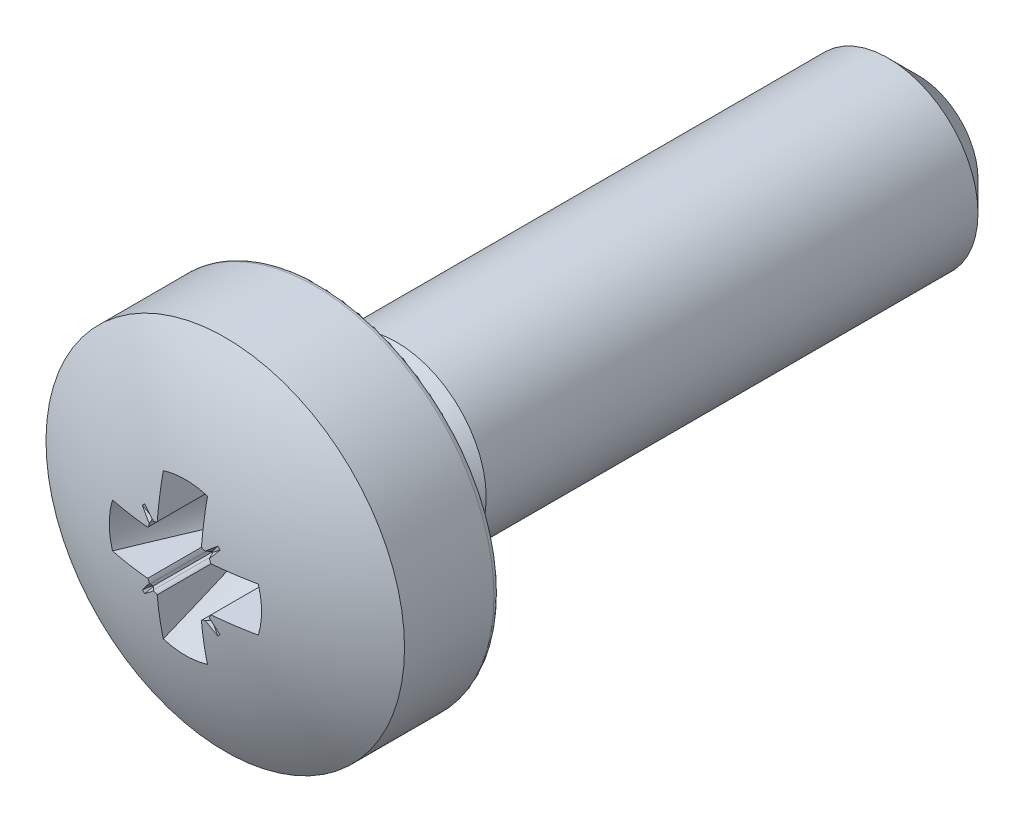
ISO-10303-21;
HEADER;
FILE_DESCRIPTION(('STEP AP214'),'2;1');
FILE_NAME('part.step','',(''),(''),'','','');
FILE_SCHEMA(('AUTOMOTIVE_DESIGN { 1 0 10303 214 1 1 1 1 }'));
ENDSEC;
DATA;
#1=APPLICATION_CONTEXT('core data for automotive mechanical design processes');
#2=APPLICATION_PROTOCOL_DEFINITION('international standard','automotive_design',2000,#1);
#3=PRODUCT_CONTEXT('',#1,'mechanical');
#4=PRODUCT('Part','Part','',(#3));
#5=PRODUCT_RELATED_PRODUCT_CATEGORY('part','',(#4));
#6=PRODUCT_DEFINITION_FORMATION('','',#4);
#7=PRODUCT_DEFINITION_CONTEXT('part definition',#1,'design');
#8=PRODUCT_DEFINITION('design','',#6,#7);
#9=PRODUCT_DEFINITION_SHAPE('','',#8);
#10=(LENGTH_UNIT() NAMED_UNIT(*) SI_UNIT(.MILLI.,.METRE.));
#11=(NAMED_UNIT(*) PLANE_ANGLE_UNIT() SI_UNIT($,.RADIAN.));
#12=(NAMED_UNIT(*) SI_UNIT($,.STERADIAN.) SOLID_ANGLE_UNIT());
#13=UNCERTAINTY_MEASURE_WITH_UNIT(LENGTH_MEASURE(1.E-05),#10,'distance_accuracy_value','');
#14=(GEOMETRIC_REPRESENTATION_CONTEXT(3) GLOBAL_UNCERTAINTY_ASSIGNED_CONTEXT((#13)) GLOBAL_UNIT_ASSIGNED_CONTEXT((#10,
#11,#12)) REPRESENTATION_CONTEXT('',''));
#15=CARTESIAN_POINT('',(0.,0.,0.));
#16=DIRECTION('',(0.,0.,1.));
#17=DIRECTION('',(1.,0.,0.));
#18=AXIS2_PLACEMENT_3D('',#15,#16,#17);
#19=CARTESIAN_POINT('',(0.,0.,-3.6));
#20=DIRECTION('',(0.,0.,1.));
#21=DIRECTION('',(0.,1.,0.));
#22=AXIS2_PLACEMENT_3D('',#19,#20,#21);
#23=SPHERICAL_SURFACE('',#22,6.);
#24=CARTESIAN_POINT('',(0.37,0.,-3.6));
#25=DIRECTION('',(1.,0.,0.));
#26=DIRECTION('',(0.,-1.,0.));
#27=AXIS2_PLACEMENT_3D('',#24,#25,#26);
#28=CIRCLE('',#27,5.98858080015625);
#29=CARTESIAN_POINT('',(0.37,-0.529627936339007,2.36511477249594));
#30=VERTEX_POINT('',#29);
#31=CARTESIAN_POINT('',(0.37,-1.22008332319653,2.2629767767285));
#32=VERTEX_POINT('',#31);
#33=EDGE_CURVE('E590',#30,#32,#28,.T.);
#34=ORIENTED_EDGE('',*,*,#33,.T.);
#35=CARTESIAN_POINT('',(0.,0.,2.2629767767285));
#36=DIRECTION('',(0.,0.,-1.));
#37=DIRECTION('',(0.,1.,0.));
#38=AXIS2_PLACEMENT_3D('',#35,#36,#37);
#39=CIRCLE('',#38,1.27495227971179);
#40=CARTESIAN_POINT('',(-0.37,-1.22008332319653,2.2629767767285));
#41=VERTEX_POINT('',#40);
#42=EDGE_CURVE('E642',#32,#41,#39,.T.);
#43=ORIENTED_EDGE('',*,*,#42,.T.);
#44=CARTESIAN_POINT('',(-0.37,0.,-3.6));
#45=DIRECTION('',(1.,0.,0.));
#46=DIRECTION('',(0.,0.,-1.));
#47=AXIS2_PLACEMENT_3D('',#44,#45,#46);
#48=CIRCLE('',#47,5.98858080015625);
#49=CARTESIAN_POINT('',(-0.37,-0.529627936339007,2.36511477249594));
#50=VERTEX_POINT('',#49);
#51=EDGE_CURVE('E646',#50,#41,#48,.T.);
#52=ORIENTED_EDGE('',*,*,#51,.F.);
#53=CARTESIAN_POINT('',(-0.444476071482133,-0.502939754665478,2.36233952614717));
#54=CARTESIAN_POINT('',(-0.437134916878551,-0.503189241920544,2.36286588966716));
#55=CARTESIAN_POINT('',(-0.429810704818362,-0.504074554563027,2.36332342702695));
#56=CARTESIAN_POINT('',(-0.415592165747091,-0.507027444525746,2.36408059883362));
#57=CARTESIAN_POINT('',(-0.408691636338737,-0.50906423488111,2.36438396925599));
#58=CARTESIAN_POINT('',(-0.396347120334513,-0.513851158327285,2.36480535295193));
#59=CARTESIAN_POINT('',(-0.390842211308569,-0.516443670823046,2.36494467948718));
#60=CARTESIAN_POINT('',(-0.380127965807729,-0.522436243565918,2.36511540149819));
#61=CARTESIAN_POINT('',(-0.37492788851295,-0.525852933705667,2.36514433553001));
#62=CARTESIAN_POINT('',(-0.3699998,-0.529628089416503,2.36511477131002));
#63=B_SPLINE_CURVE_WITH_KNOTS('',3,(#53,#54,#55,#56,#57,#58,#59,#60,#61,#62),.UNSPECIFIED.,.F.,
.F.,(4,2,2,2,4),(0.,0.0220666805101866,0.0435695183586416,0.061769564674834,0.0803731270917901),.UNSPECIFIED.);
#64=CARTESIAN_POINT('',(-0.433188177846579,-0.503827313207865,2.36309534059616));
#65=VERTEX_POINT('',#64);
#66=EDGE_CURVE('E697',#65,#50,#63,.T.);
#67=ORIENTED_EDGE('',*,*,#66,.F.);
#68=CARTESIAN_POINT('',(-2.01420445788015,2.01420445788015,-1.41425736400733));
#69=DIRECTION('',(-0.560985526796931,0.560985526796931,0.608761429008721));
#70=DIRECTION('',(0.,-0.735373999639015,0.677661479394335));
#71=AXIS2_PLACEMENT_3D('',#68,#69,#70);
#72=CIRCLE('',#71,4.80712907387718);
#73=CARTESIAN_POINT('',(-0.612970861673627,-0.650954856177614,2.33300299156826));
#74=VERTEX_POINT('',#73);
#75=EDGE_CURVE('E703',#74,#65,#72,.T.);
#76=ORIENTED_EDGE('',*,*,#75,.F.);
#77=CARTESIAN_POINT('',(0.546007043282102,0.546007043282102,2.10762743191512));
#78=DIRECTION('',(0.0947990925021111,0.0947990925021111,0.990972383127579));
#79=DIRECTION('',(0.995455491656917,0.,-0.0952279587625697));
#80=AXIS2_PLACEMENT_3D('',#77,#78,#79);
#81=CIRCLE('',#80,1.68129168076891);
#82=CARTESIAN_POINT('',(-0.650954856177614,-0.612970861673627,2.33300299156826));
#83=VERTEX_POINT('',#82);
#84=EDGE_CURVE('E1013',#83,#74,#81,.T.);
#85=ORIENTED_EDGE('',*,*,#84,.F.);
#86=CARTESIAN_POINT('',(2.01420445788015,-2.01420445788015,-1.41425736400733));
#87=DIRECTION('',(-0.560985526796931,0.560985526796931,-0.608761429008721));
#88=DIRECTION('',(-0.735373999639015,0.,0.677661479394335));
#89=AXIS2_PLACEMENT_3D('',#86,#87,#88);
#90=CIRCLE('',#89,4.80712907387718);
#91=CARTESIAN_POINT('',(-0.503827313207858,-0.433188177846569,2.36309534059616));
#92=VERTEX_POINT('',#91);
#93=EDGE_CURVE('E877',#83,#92,#90,.T.);
#94=ORIENTED_EDGE('',*,*,#93,.T.);
#95=CARTESIAN_POINT('',(-0.502939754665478,-0.444476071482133,2.36233952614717));
#96=CARTESIAN_POINT('',(-0.503189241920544,-0.437134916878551,2.36286588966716));
#97=CARTESIAN_POINT('',(-0.504074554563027,-0.429810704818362,2.36332342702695));
#98=CARTESIAN_POINT('',(-0.507027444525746,-0.415592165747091,2.36408059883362));
#99=CARTESIAN_POINT('',(-0.50906423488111,-0.408691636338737,2.36438396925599));
#100=CARTESIAN_POINT('',(-0.513851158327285,-0.396347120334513,2.36480535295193));
#101=CARTESIAN_POINT('',(-0.516443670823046,-0.390842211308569,2.36494467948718));
#102=CARTESIAN_POINT('',(-0.522436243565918,-0.380127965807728,2.36511540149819));
#103=CARTESIAN_POINT('',(-0.525852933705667,-0.37492788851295,2.36514433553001));
#104=CARTESIAN_POINT('',(-0.529628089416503,-0.3699998,2.36511477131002));
#105=B_SPLINE_CURVE_WITH_KNOTS('',3,(#95,#96,#97,#98,#99,#100,#101,#102,#103,#104),
.UNSPECIFIED.,.F.,.F.,(4,2,2,2,4),(0.,0.0220666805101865,0.0435695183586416,0.0617695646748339,
0.0803731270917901),.UNSPECIFIED.);
#106=CARTESIAN_POINT('',(-0.529627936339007,-0.37,2.36511477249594));
#107=VERTEX_POINT('',#106);
#108=EDGE_CURVE('E878',#92,#107,#105,.T.);
#109=ORIENTED_EDGE('',*,*,#108,.T.);
#110=CARTESIAN_POINT('',(0.,-0.37,-3.6));
#111=DIRECTION('',(0.,1.,0.));
#112=DIRECTION('',(0.,0.,1.));
#113=AXIS2_PLACEMENT_3D('',#110,#111,#112);
#114=CIRCLE('',#113,5.98858080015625);
#115=CARTESIAN_POINT('',(-1.22008332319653,-0.37,2.2629767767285));
#116=VERTEX_POINT('',#115);
#117=EDGE_CURVE('E1025',#116,#107,#114,.T.);
#118=ORIENTED_EDGE('',*,*,#117,.F.);
#119=CARTESIAN_POINT('',(0.,0.,2.2629767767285));
#120=DIRECTION('',(0.,0.,-1.));
#121=DIRECTION('',(0.,1.,0.));
#122=AXIS2_PLACEMENT_3D('',#119,#120,#121);
#123=CIRCLE('',#122,1.27495227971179);
#124=CARTESIAN_POINT('',(-1.22008332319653,0.37,2.2629767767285));
#125=VERTEX_POINT('',#124);
#126=EDGE_CURVE('E1030',#116,#125,#123,.T.);
#127=ORIENTED_EDGE('',*,*,#126,.T.);
#128=CARTESIAN_POINT('',(0.,0.37,-3.6));
#129=DIRECTION('',(0.,1.,0.));
#130=DIRECTION('',(0.,0.,1.));
#131=AXIS2_PLACEMENT_3D('',#128,#129,#130);
#132=CIRCLE('',#131,5.98858080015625);
#133=CARTESIAN_POINT('',(-0.529627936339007,0.37,2.36511477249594));
#134=VERTEX_POINT('',#133);
#135=EDGE_CURVE('E1039',#125,#134,#132,.T.);
#136=ORIENTED_EDGE('',*,*,#135,.T.);
#137=CARTESIAN_POINT('',(-0.502939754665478,0.444476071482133,2.36233952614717));
#138=CARTESIAN_POINT('',(-0.503189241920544,0.437134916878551,2.36286588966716));
#139=CARTESIAN_POINT('',(-0.504074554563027,0.429810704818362,2.36332342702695));
#140=CARTESIAN_POINT('',(-0.507027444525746,0.415592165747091,2.36408059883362));
#141=CARTESIAN_POINT('',(-0.50906423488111,0.408691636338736,2.36438396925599));
#142=CARTESIAN_POINT('',(-0.513851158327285,0.396347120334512,2.36480535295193));
#143=CARTESIAN_POINT('',(-0.516443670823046,0.390842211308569,2.36494467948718));
#144=CARTESIAN_POINT('',(-0.522436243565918,0.380127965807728,2.36511540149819));
#145=CARTESIAN_POINT('',(-0.525852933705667,0.374927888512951,2.36514433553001));
#146=CARTESIAN_POINT('',(-0.529628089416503,0.3699998,2.36511477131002));
#147=B_SPLINE_CURVE_WITH_KNOTS('',3,(#137,#138,#139,#140,#141,#142,#143,#144,#145,#146),
.UNSPECIFIED.,.F.,.F.,(4,2,2,2,4),(0.,0.0220666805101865,0.0435695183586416,0.0617695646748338,
0.0803731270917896),.UNSPECIFIED.);
#148=CARTESIAN_POINT('',(-0.503827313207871,0.433188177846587,2.36309534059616));
#149=VERTEX_POINT('',#148);
#150=EDGE_CURVE('E54',#149,#134,#147,.T.);
#151=ORIENTED_EDGE('',*,*,#150,.F.);
#152=CARTESIAN_POINT('',(2.01420445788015,2.01420445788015,-1.41425736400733));
#153=DIRECTION('',(0.560985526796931,0.560985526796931,0.608761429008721));
#154=DIRECTION('',(0.735373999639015,0.,-0.677661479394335));
#155=AXIS2_PLACEMENT_3D('',#152,#153,#154);
#156=CIRCLE('',#155,4.80712907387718);
#157=CARTESIAN_POINT('',(-0.650954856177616,0.612970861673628,2.33300299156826));
#158=VERTEX_POINT('',#157);
#159=EDGE_CURVE('E371',#158,#149,#156,.T.);
#160=ORIENTED_EDGE('',*,*,#159,.F.);
#161=CARTESIAN_POINT('',(0.546007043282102,-0.546007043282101,2.10762743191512));
#162=DIRECTION('',(0.094799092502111,-0.094799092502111,0.990972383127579));
#163=DIRECTION('',(0.995455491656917,0.,-0.0952279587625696));
#164=AXIS2_PLACEMENT_3D('',#161,#162,#163);
#165=CIRCLE('',#164,1.68129168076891);
#166=CARTESIAN_POINT('',(-0.612970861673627,0.650954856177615,2.33300299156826));
#167=VERTEX_POINT('',#166);
#168=EDGE_CURVE('E322',#167,#158,#165,.T.);
#169=ORIENTED_EDGE('',*,*,#168,.F.);
#170=CARTESIAN_POINT('',(-2.01420445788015,-2.01420445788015,-1.41425736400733));
#171=DIRECTION('',(0.560985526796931,0.560985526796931,-0.608761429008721));
#172=DIRECTION('',(-0.735373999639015,0.,-0.677661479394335));
#173=AXIS2_PLACEMENT_3D('',#170,#171,#172);
#174=CIRCLE('',#173,4.80712907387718);
#175=CARTESIAN_POINT('',(-0.433188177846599,0.503827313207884,2.36309534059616));
#176=VERTEX_POINT('',#175);
#177=EDGE_CURVE('E374',#167,#176,#174,.T.);
#178=ORIENTED_EDGE('',*,*,#177,.T.);
#179=CARTESIAN_POINT('',(-0.444476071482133,0.502939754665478,2.36233952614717));
#180=CARTESIAN_POINT('',(-0.437134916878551,0.503189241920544,2.36286588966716));
#181=CARTESIAN_POINT('',(-0.429810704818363,0.504074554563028,2.36332342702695));
#182=CARTESIAN_POINT('',(-0.415592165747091,0.507027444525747,2.36408059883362));
#183=CARTESIAN_POINT('',(-0.408691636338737,0.50906423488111,2.36438396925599));
#184=CARTESIAN_POINT('',(-0.396347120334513,0.513851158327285,2.36480535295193));
#185=CARTESIAN_POINT('',(-0.390842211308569,0.516443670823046,2.36494467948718));
#186=CARTESIAN_POINT('',(-0.380127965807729,0.522436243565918,2.36511540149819));
#187=CARTESIAN_POINT('',(-0.374927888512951,0.525852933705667,2.36514433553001));
#188=CARTESIAN_POINT('',(-0.3699998,0.529628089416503,2.36511477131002));
#189=B_SPLINE_CURVE_WITH_KNOTS('',3,(#179,#180,#181,#182,#183,#184,#185,#186,#187,#188),
.UNSPECIFIED.,.F.,.F.,(4,2,2,2,4),(0.,0.0220666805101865,0.0435695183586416,0.0617695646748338,
0.08037312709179),.UNSPECIFIED.);
#190=CARTESIAN_POINT('',(-0.37,0.529627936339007,2.36511477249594));
#191=VERTEX_POINT('',#190);
#192=EDGE_CURVE('E377',#176,#191,#189,.T.);
#193=ORIENTED_EDGE('',*,*,#192,.T.);
#194=CARTESIAN_POINT('',(-0.37,0.,-3.6));
#195=DIRECTION('',(1.,0.,0.));
#196=DIRECTION('',(0.,0.,-1.));
#197=AXIS2_PLACEMENT_3D('',#194,#195,#196);
#198=CIRCLE('',#197,5.98858080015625);
#199=CARTESIAN_POINT('',(-0.37,1.22008332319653,2.2629767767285));
#200=VERTEX_POINT('',#199);
#201=EDGE_CURVE('E384',#200,#191,#198,.T.);
#202=ORIENTED_EDGE('',*,*,#201,.F.);
#203=CARTESIAN_POINT('',(0.,0.,2.2629767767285));
#204=DIRECTION('',(0.,0.,-1.));
#205=DIRECTION('',(0.,1.,0.));
#206=AXIS2_PLACEMENT_3D('',#203,#204,#205);
#207=CIRCLE('',#206,1.27495227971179);
#208=CARTESIAN_POINT('',(0.37,1.22008332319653,2.2629767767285));
#209=VERTEX_POINT('',#208);
#210=EDGE_CURVE('E1519',#200,#209,#207,.T.);
#211=ORIENTED_EDGE('',*,*,#210,.T.);
#212=CARTESIAN_POINT('',(0.37,0.,-3.6));
#213=DIRECTION('',(1.,0.,0.));
#214=DIRECTION('',(0.,0.,-1.));
#215=AXIS2_PLACEMENT_3D('',#212,#213,#214);
#216=CIRCLE('',#215,5.98858080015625);
#217=CARTESIAN_POINT('',(0.37,0.529627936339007,2.36511477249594));
#218=VERTEX_POINT('',#217);
#219=EDGE_CURVE('E1051',#209,#218,#216,.T.);
#220=ORIENTED_EDGE('',*,*,#219,.T.);
#221=CARTESIAN_POINT('',(0.444476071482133,0.502939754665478,2.36233952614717));
#222=CARTESIAN_POINT('',(0.437134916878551,0.503189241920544,2.36286588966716));
#223=CARTESIAN_POINT('',(0.429810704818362,0.504074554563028,2.36332342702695));
#224=CARTESIAN_POINT('',(0.415592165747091,0.507027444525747,2.36408059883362));
#225=CARTESIAN_POINT('',(0.408691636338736,0.50906423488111,2.36438396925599));
#226=CARTESIAN_POINT('',(0.396347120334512,0.513851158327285,2.36480535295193));
#227=CARTESIAN_POINT('',(0.390842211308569,0.516443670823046,2.36494467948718));
#228=CARTESIAN_POINT('',(0.380127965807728,0.522436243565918,2.36511540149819));
#229=CARTESIAN_POINT('',(0.374927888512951,0.525852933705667,2.36514433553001));
#230=CARTESIAN_POINT('',(0.3699998,0.529628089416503,2.36511477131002));
#231=B_SPLINE_CURVE_WITH_KNOTS('',3,(#221,#222,#223,#224,#225,#226,#227,#228,#229,#230),
.UNSPECIFIED.,.F.,.F.,(4,2,2,2,4),(0.,0.0220666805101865,0.0435695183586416,0.0617695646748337,
0.0803731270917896),.UNSPECIFIED.);
#232=CARTESIAN_POINT('',(0.433188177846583,0.50382731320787,2.36309534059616));
#233=VERTEX_POINT('',#232);
#234=EDGE_CURVE('E1046',#233,#218,#231,.T.);
#235=ORIENTED_EDGE('',*,*,#234,.F.);
#236=CARTESIAN_POINT('',(2.01420445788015,-2.01420445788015,-1.41425736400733));
#237=DIRECTION('',(0.560985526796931,-0.560985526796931,0.608761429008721));
#238=DIRECTION('',(0.,-0.735373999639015,-0.677661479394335));
#239=AXIS2_PLACEMENT_3D('',#236,#237,#238);
#240=CIRCLE('',#239,4.80712907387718);
#241=CARTESIAN_POINT('',(0.612970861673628,0.650954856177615,2.33300299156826));
#242=VERTEX_POINT('',#241);
#243=EDGE_CURVE('E1037',#242,#233,#240,.T.);
#244=ORIENTED_EDGE('',*,*,#243,.F.);
#245=CARTESIAN_POINT('',(-0.546007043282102,-0.546007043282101,2.10762743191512));
#246=DIRECTION('',(-0.0947990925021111,-0.0947990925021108,0.990972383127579));
#247=DIRECTION('',(0.995455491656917,0.,0.0952279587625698));
#248=AXIS2_PLACEMENT_3D('',#245,#246,#247);
#249=CIRCLE('',#248,1.68129168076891);
#250=CARTESIAN_POINT('',(0.650954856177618,0.61297086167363,2.33300299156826));
#251=VERTEX_POINT('',#250);
#252=EDGE_CURVE('E1035',#251,#242,#249,.T.);
#253=ORIENTED_EDGE('',*,*,#252,.F.);
#254=CARTESIAN_POINT('',(-2.01420445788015,2.01420445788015,-1.41425736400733));
#255=DIRECTION('',(0.560985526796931,-0.560985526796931,-0.608761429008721));
#256=DIRECTION('',(0.,0.735373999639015,-0.677661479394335));
#257=AXIS2_PLACEMENT_3D('',#254,#255,#256);
#258=CIRCLE('',#257,4.80712907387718);
#259=CARTESIAN_POINT('',(0.503827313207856,0.433188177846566,2.36309534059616));
#260=VERTEX_POINT('',#259);
#261=EDGE_CURVE('E1026',#251,#260,#258,.T.);
#262=ORIENTED_EDGE('',*,*,#261,.T.);
#263=CARTESIAN_POINT('',(0.502939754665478,0.444476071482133,2.36233952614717));
#264=CARTESIAN_POINT('',(0.503189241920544,0.437134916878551,2.36286588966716));
#265=CARTESIAN_POINT('',(0.504074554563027,0.429810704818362,2.36332342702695));
#266=CARTESIAN_POINT('',(0.507027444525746,0.415592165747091,2.36408059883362));
#267=CARTESIAN_POINT('',(0.50906423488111,0.408691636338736,2.36438396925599));
#268=CARTESIAN_POINT('',(0.513851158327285,0.396347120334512,2.36480535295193));
#269=CARTESIAN_POINT('',(0.516443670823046,0.390842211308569,2.36494467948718));
#270=CARTESIAN_POINT('',(0.522436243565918,0.380127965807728,2.36511540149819));
#271=CARTESIAN_POINT('',(0.525852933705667,0.37492788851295,2.36514433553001));
#272=CARTESIAN_POINT('',(0.529628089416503,0.3699998,2.36511477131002));
#273=B_SPLINE_CURVE_WITH_KNOTS('',3,(#263,#264,#265,#266,#267,#268,#269,#270,#271,#272),
.UNSPECIFIED.,.F.,.F.,(4,2,2,2,4),(0.,0.0220666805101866,0.0435695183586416,0.0617695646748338,
0.0803731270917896),.UNSPECIFIED.);
#274=CARTESIAN_POINT('',(0.529627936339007,0.37,2.36511477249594));
#275=VERTEX_POINT('',#274);
#276=EDGE_CURVE('E870',#260,#275,#273,.T.);
#277=ORIENTED_EDGE('',*,*,#276,.T.);
#278=CARTESIAN_POINT('',(0.,0.37,-3.6));
#279=DIRECTION('',(0.,1.,0.));
#280=DIRECTION('',(0.,0.,1.));
#281=AXIS2_PLACEMENT_3D('',#278,#279,#280);
#282=CIRCLE('',#281,5.98858080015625);
#283=CARTESIAN_POINT('',(1.22008332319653,0.37,2.2629767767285));
#284=VERTEX_POINT('',#283);
#285=EDGE_CURVE('E885',#275,#284,#282,.T.);
#286=ORIENTED_EDGE('',*,*,#285,.T.);
#287=CARTESIAN_POINT('',(0.,0.,2.2629767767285));
#288=DIRECTION('',(0.,0.,-1.));
#289=DIRECTION('',(0.,1.,0.));
#290=AXIS2_PLACEMENT_3D('',#287,#288,#289);
#291=CIRCLE('',#290,1.27495227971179);
#292=CARTESIAN_POINT('',(1.22008332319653,-0.37,2.2629767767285));
#293=VERTEX_POINT('',#292);
#294=EDGE_CURVE('E888',#284,#293,#291,.T.);
#295=ORIENTED_EDGE('',*,*,#294,.T.);
#296=CARTESIAN_POINT('',(0.,-0.37,-3.6));
#297=DIRECTION('',(0.,1.,0.));
#298=DIRECTION('',(0.,0.,1.));
#299=AXIS2_PLACEMENT_3D('',#296,#297,#298);
#300=CIRCLE('',#299,5.98858080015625);
#301=CARTESIAN_POINT('',(0.529627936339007,-0.37,2.36511477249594));
#302=VERTEX_POINT('',#301);
#303=EDGE_CURVE('E891',#302,#293,#300,.T.);
#304=ORIENTED_EDGE('',*,*,#303,.F.);
#305=CARTESIAN_POINT('',(0.502939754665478,-0.444476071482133,2.36233952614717));
#306=CARTESIAN_POINT('',(0.503189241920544,-0.437134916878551,2.36286588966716));
#307=CARTESIAN_POINT('',(0.504074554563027,-0.429810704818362,2.36332342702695));
#308=CARTESIAN_POINT('',(0.507027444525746,-0.415592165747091,2.36408059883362));
#309=CARTESIAN_POINT('',(0.50906423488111,-0.408691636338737,2.36438396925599));
#310=CARTESIAN_POINT('',(0.513851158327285,-0.396347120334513,2.36480535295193));
#311=CARTESIAN_POINT('',(0.516443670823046,-0.390842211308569,2.36494467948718));
#312=CARTESIAN_POINT('',(0.522436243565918,-0.380127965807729,2.36511540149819));
#313=CARTESIAN_POINT('',(0.525852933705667,-0.374927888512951,2.36514433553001));
#314=CARTESIAN_POINT('',(0.529628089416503,-0.3699998,2.36511477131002));
#315=B_SPLINE_CURVE_WITH_KNOTS('',3,(#305,#306,#307,#308,#309,#310,#311,#312,#313,#314),
.UNSPECIFIED.,.F.,.F.,(4,2,2,2,4),(0.,0.0220666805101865,0.0435695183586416,0.0617695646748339,
0.08037312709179),.UNSPECIFIED.);
#316=CARTESIAN_POINT('',(0.503827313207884,-0.4331881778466,2.36309534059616));
#317=VERTEX_POINT('',#316);
#318=EDGE_CURVE('E893',#317,#302,#315,.T.);
#319=ORIENTED_EDGE('',*,*,#318,.F.);
#320=CARTESIAN_POINT('',(-2.01420445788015,-2.01420445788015,-1.41425736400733));
#321=DIRECTION('',(-0.560985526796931,-0.560985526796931,0.608761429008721));
#322=DIRECTION('',(0.735373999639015,0.,0.677661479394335));
#323=AXIS2_PLACEMENT_3D('',#320,#321,#322);
#324=CIRCLE('',#323,4.80712907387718);
#325=CARTESIAN_POINT('',(0.650954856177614,-0.612970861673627,2.33300299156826));
#326=VERTEX_POINT('',#325);
#327=EDGE_CURVE('E898',#326,#317,#324,.T.);
#328=ORIENTED_EDGE('',*,*,#327,.F.);
#329=CARTESIAN_POINT('',(-0.546007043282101,0.546007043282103,2.10762743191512));
#330=DIRECTION('',(-0.094799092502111,0.0947990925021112,0.990972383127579));
#331=DIRECTION('',(0.,-0.995455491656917,0.0952279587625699));
#332=AXIS2_PLACEMENT_3D('',#329,#330,#331);
#333=CIRCLE('',#332,1.68129168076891);
#334=CARTESIAN_POINT('',(0.612970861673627,-0.650954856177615,2.33300299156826));
#335=VERTEX_POINT('',#334);
#336=EDGE_CURVE('E702',#335,#326,#333,.T.);
#337=ORIENTED_EDGE('',*,*,#336,.F.);
#338=CARTESIAN_POINT('',(2.01420445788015,2.01420445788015,-1.41425736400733));
#339=DIRECTION('',(-0.560985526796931,-0.560985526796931,-0.608761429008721));
#340=DIRECTION('',(0.,0.735373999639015,-0.677661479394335));
#341=AXIS2_PLACEMENT_3D('',#338,#339,#340);
#342=CIRCLE('',#341,4.80712907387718);
#343=CARTESIAN_POINT('',(0.433188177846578,-0.503827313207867,2.36309534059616));
#344=VERTEX_POINT('',#343);
#345=EDGE_CURVE('E653',#335,#344,#342,.T.);
#346=ORIENTED_EDGE('',*,*,#345,.T.);
#347=CARTESIAN_POINT('',(0.444476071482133,-0.502939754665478,2.36233952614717));
#348=CARTESIAN_POINT('',(0.437134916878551,-0.503189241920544,2.36286588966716));
#349=CARTESIAN_POINT('',(0.429810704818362,-0.504074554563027,2.36332342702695));
#350=CARTESIAN_POINT('',(0.415592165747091,-0.507027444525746,2.36408059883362));
#351=CARTESIAN_POINT('',(0.408691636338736,-0.50906423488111,2.36438396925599));
#352=CARTESIAN_POINT('',(0.396347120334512,-0.513851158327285,2.36480535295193));
#353=CARTESIAN_POINT('',(0.390842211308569,-0.516443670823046,2.36494467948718));
#354=CARTESIAN_POINT('',(0.380127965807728,-0.522436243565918,2.36511540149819));
#355=CARTESIAN_POINT('',(0.37492788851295,-0.525852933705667,2.36514433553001));
#356=CARTESIAN_POINT('',(0.3699998,-0.529628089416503,2.36511477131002));
#357=B_SPLINE_CURVE_WITH_KNOTS('',3,(#347,#348,#349,#350,#351,#352,#353,#354,#355,#356),
.UNSPECIFIED.,.F.,.F.,(4,2,2,2,4),(0.,0.0220666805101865,0.0435695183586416,0.0617695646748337,
0.0803731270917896),.UNSPECIFIED.);
#358=EDGE_CURVE('E648',#344,#30,#357,.T.);
#359=ORIENTED_EDGE('',*,*,#358,.T.);
#360=EDGE_LOOP('',(#34,#43,#52,#67,#76,#85,#94,#109,#118,#127,#136,#151,#160,#169,#178,#193,
#202,#211,#220,#235,#244,#253,#262,#277,#286,#295,#304,#319,#328,#337,#346,#359));
#361=FACE_BOUND('',#360,.T.);
#362=CARTESIAN_POINT('',(0.,0.,1.59615242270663));
#363=DIRECTION('',(0.,0.,1.));
#364=DIRECTION('',(1.,0.,0.));
#365=AXIS2_PLACEMENT_3D('',#362,#363,#364);
#366=CIRCLE('',#365,3.);
#367=CARTESIAN_POINT('',(3.,0.,1.59615242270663));
#368=VERTEX_POINT('',#367);
#369=EDGE_CURVE('E341',#368,#368,#366,.T.);
#370=ORIENTED_EDGE('',*,*,#369,.T.);
#371=EDGE_LOOP('',(#370));
#372=FACE_BOUND('',#371,.T.);
#373=ADVANCED_FACE('F31',(#361,#372),#23,.T.);
#374=CARTESIAN_POINT('',(0.,0.,-10.));
#375=DIRECTION('',(0.,0.,1.));
#376=DIRECTION('',(1.,0.,0.));
#377=AXIS2_PLACEMENT_3D('',#374,#375,#376);
#378=PLANE('',#377);
#379=CARTESIAN_POINT('',(0.,0.,-10.));
#380=DIRECTION('',(0.,0.,1.));
#381=DIRECTION('',(1.,0.,0.));
#382=AXIS2_PLACEMENT_3D('',#379,#380,#381);
#383=CIRCLE('',#382,0.999999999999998);
#384=CARTESIAN_POINT('',(0.999999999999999,0.,-10.));
#385=VERTEX_POINT('',#384);
#386=EDGE_CURVE('E11',#385,#385,#383,.F.);
#387=ORIENTED_EDGE('',*,*,#386,.T.);
#388=EDGE_LOOP('',(#387));
#389=FACE_BOUND('',#388,.T.);
#390=ADVANCED_FACE('F579',(#389),#378,.F.);
#391=CARTESIAN_POINT('',(0.,0.,0.));
#392=DIRECTION('',(0.,0.,1.));
#393=DIRECTION('',(1.,0.,0.));
#394=AXIS2_PLACEMENT_3D('',#391,#392,#393);
#395=CYLINDRICAL_SURFACE('',#394,1.5);
#396=CARTESIAN_POINT('',(0.,0.,-9.5));
#397=DIRECTION('',(0.,0.,1.));
#398=DIRECTION('',(1.,0.,0.));
#399=AXIS2_PLACEMENT_3D('',#396,#397,#398);
#400=CIRCLE('',#399,1.5);
#401=CARTESIAN_POINT('',(1.5,0.,-9.5));
#402=VERTEX_POINT('',#401);
#403=EDGE_CURVE('E39',#402,#402,#400,.T.);
#404=ORIENTED_EDGE('',*,*,#403,.T.);
#405=EDGE_LOOP('',(#404));
#406=FACE_BOUND('',#405,.T.);
#407=CARTESIAN_POINT('',(0.,0.,-1.270625));
#408=DIRECTION('',(0.,0.,1.));
#409=DIRECTION('',(1.,0.,0.));
#410=AXIS2_PLACEMENT_3D('',#407,#408,#409);
#411=CIRCLE('',#410,1.5);
#412=CARTESIAN_POINT('',(1.5,0.,-1.270625));
#413=VERTEX_POINT('',#412);
#414=EDGE_CURVE('E368',#413,#413,#411,.T.);
#415=ORIENTED_EDGE('',*,*,#414,.F.);
#416=EDGE_LOOP('',(#415));
#417=FACE_BOUND('',#416,.T.);
#418=ADVANCED_FACE('F584',(#406,#417),#395,.T.);
#419=CARTESIAN_POINT('',(0.,0.,-1.270625));
#420=DIRECTION('',(0.,0.,-1.));
#421=DIRECTION('',(-1.,0.,0.));
#422=AXIS2_PLACEMENT_3D('',#419,#420,#421);
#423=CONICAL_SURFACE('',#422,1.5,0.785398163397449);
#424=CARTESIAN_POINT('',(0.,0.,-1.));
#425=DIRECTION('',(0.,0.,1.));
#426=DIRECTION('',(1.,0.,0.));
#427=AXIS2_PLACEMENT_3D('',#424,#425,#426);
#428=CIRCLE('',#427,1.229375);
#429=CARTESIAN_POINT('',(1.229375,0.,-1.));
#430=VERTEX_POINT('',#429);
#431=EDGE_CURVE('E365',#430,#430,#428,.T.);
#432=ORIENTED_EDGE('',*,*,#431,.F.);
#433=EDGE_LOOP('',(#432));
#434=FACE_BOUND('',#433,.T.);
#435=ORIENTED_EDGE('',*,*,#414,.T.);
#436=EDGE_LOOP('',(#435));
#437=FACE_BOUND('',#436,.T.);
#438=ADVANCED_FACE('F627',(#434,#437),#423,.T.);
#439=CARTESIAN_POINT('',(0.,0.,0.));
#440=DIRECTION('',(0.,0.,1.));
#441=DIRECTION('',(1.,0.,0.));
#442=AXIS2_PLACEMENT_3D('',#439,#440,#441);
#443=CYLINDRICAL_SURFACE('',#442,1.229375);
#444=CARTESIAN_POINT('',(0.,0.,-0.9));
#445=DIRECTION('',(0.,0.,1.));
#446=DIRECTION('',(1.,0.,0.));
#447=AXIS2_PLACEMENT_3D('',#444,#445,#446);
#448=CIRCLE('',#447,1.229375);
#449=CARTESIAN_POINT('',(1.229375,0.,-0.9));
#450=VERTEX_POINT('',#449);
#451=EDGE_CURVE('E362',#450,#450,#448,.T.);
#452=ORIENTED_EDGE('',*,*,#451,.F.);
#453=EDGE_LOOP('',(#452));
#454=FACE_BOUND('',#453,.T.);
#455=ORIENTED_EDGE('',*,*,#431,.T.);
#456=EDGE_LOOP('',(#455));
#457=FACE_BOUND('',#456,.T.);
#458=ADVANCED_FACE('F623',(#454,#457),#443,.T.);
#459=CARTESIAN_POINT('',(0.,0.,-0.9));
#460=DIRECTION('',(0.,0.,1.));
#461=DIRECTION('',(1.,0.,0.));
#462=AXIS2_PLACEMENT_3D('',#459,#460,#461);
#463=TOROIDAL_SURFACE('',#462,1.329375,0.1);
#464=ORIENTED_EDGE('',*,*,#451,.T.);
#465=EDGE_LOOP('',(#464));
#466=FACE_BOUND('',#465,.T.);
#467=CARTESIAN_POINT('',(0.,0.,-0.857963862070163));
#468=DIRECTION('',(0.,0.,1.));
#469=DIRECTION('',(1.,0.,0.));
#470=AXIS2_PLACEMENT_3D('',#467,#468,#469);
#471=CIRCLE('',#470,1.23863932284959);
#472=CARTESIAN_POINT('',(1.23863932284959,0.,-0.857963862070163));
#473=VERTEX_POINT('',#472);
#474=EDGE_CURVE('E359',#473,#473,#471,.T.);
#475=ORIENTED_EDGE('',*,*,#474,.F.);
#476=EDGE_LOOP('',(#475));
#477=FACE_BOUND('',#476,.T.);
#478=ADVANCED_FACE('F617',(#466,#477),#463,.F.);
#479=CARTESIAN_POINT('',(0.,0.,-0.857963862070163));
#480=DIRECTION('',(0.,0.,1.));
#481=DIRECTION('',(1.,0.,0.));
#482=AXIS2_PLACEMENT_3D('',#479,#480,#481);
#483=CONICAL_SURFACE('',#482,1.23863932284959,0.433843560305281);
#484=CARTESIAN_POINT('',(0.,0.,-0.0579638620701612));
#485=DIRECTION('',(0.,0.,1.));
#486=DIRECTION('',(1.,0.,0.));
#487=AXIS2_PLACEMENT_3D('',#484,#485,#486);
#488=CIRCLE('',#487,1.60926432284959);
#489=CARTESIAN_POINT('',(1.60926432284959,0.,-0.0579638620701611));
#490=VERTEX_POINT('',#489);
#491=EDGE_CURVE('E356',#490,#490,#488,.T.);
#492=ORIENTED_EDGE('',*,*,#491,.F.);
#493=EDGE_LOOP('',(#492));
#494=FACE_BOUND('',#493,.T.);
#495=ORIENTED_EDGE('',*,*,#474,.T.);
#496=EDGE_LOOP('',(#495));
#497=FACE_BOUND('',#496,.T.);
#498=ADVANCED_FACE('F611',(#494,#497),#483,.T.);
#499=CARTESIAN_POINT('',(0.,0.,-0.1));
#500=DIRECTION('',(0.,0.,1.));
#501=DIRECTION('',(1.,0.,0.));
#502=AXIS2_PLACEMENT_3D('',#499,#500,#501);
#503=TOROIDAL_SURFACE('',#502,1.7,0.1);
#504=ORIENTED_EDGE('',*,*,#491,.T.);
#505=EDGE_LOOP('',(#504));
#506=FACE_BOUND('',#505,.T.);
#507=CARTESIAN_POINT('',(0.,0.,0.));
#508=DIRECTION('',(0.,0.,1.));
#509=DIRECTION('',(1.,0.,0.));
#510=AXIS2_PLACEMENT_3D('',#507,#508,#509);
#511=CIRCLE('',#510,1.7);
#512=CARTESIAN_POINT('',(1.7,0.,0.));
#513=VERTEX_POINT('',#512);
#514=EDGE_CURVE('E353',#513,#513,#511,.T.);
#515=ORIENTED_EDGE('',*,*,#514,.F.);
#516=EDGE_LOOP('',(#515));
#517=FACE_BOUND('',#516,.T.);
#518=ADVANCED_FACE('F606',(#506,#517),#503,.F.);
#519=CARTESIAN_POINT('',(0.,1.7,0.));
#520=DIRECTION('',(0.,0.,1.));
#521=DIRECTION('',(1.,0.,0.));
#522=AXIS2_PLACEMENT_3D('',#519,#520,#521);
#523=PLANE('',#522);
#524=CARTESIAN_POINT('',(0.,0.,0.));
#525=DIRECTION('',(0.,0.,1.));
#526=DIRECTION('',(1.,0.,0.));
#527=AXIS2_PLACEMENT_3D('',#524,#525,#526);
#528=CIRCLE('',#527,2.9);
#529=CARTESIAN_POINT('',(2.9,0.,0.));
#530=VERTEX_POINT('',#529);
#531=EDGE_CURVE('E350',#530,#530,#528,.T.);
#532=ORIENTED_EDGE('',*,*,#531,.F.);
#533=EDGE_LOOP('',(#532));
#534=FACE_BOUND('',#533,.T.);
#535=ORIENTED_EDGE('',*,*,#514,.T.);
#536=EDGE_LOOP('',(#535));
#537=FACE_BOUND('',#536,.T.);
#538=ADVANCED_FACE('F601',(#534,#537),#523,.F.);
#539=CARTESIAN_POINT('',(0.,0.,0.1));
#540=DIRECTION('',(0.,0.,1.));
#541=DIRECTION('',(1.,0.,0.));
#542=AXIS2_PLACEMENT_3D('',#539,#540,#541);
#543=TOROIDAL_SURFACE('',#542,2.9,0.1);
#544=CARTESIAN_POINT('',(0.,0.,0.1));
#545=DIRECTION('',(0.,0.,1.));
#546=DIRECTION('',(1.,0.,0.));
#547=AXIS2_PLACEMENT_3D('',#544,#545,#546);
#548=CIRCLE('',#547,3.);
#549=CARTESIAN_POINT('',(3.,0.,0.1));
#550=VERTEX_POINT('',#549);
#551=EDGE_CURVE('E347',#550,#550,#548,.T.);
#552=ORIENTED_EDGE('',*,*,#551,.F.);
#553=EDGE_LOOP('',(#552));
#554=FACE_BOUND('',#553,.T.);
#555=ORIENTED_EDGE('',*,*,#531,.T.);
#556=EDGE_LOOP('',(#555));
#557=FACE_BOUND('',#556,.T.);
#558=ADVANCED_FACE('F596',(#554,#557),#543,.T.);
#559=CARTESIAN_POINT('',(0.,0.,0.));
#560=DIRECTION('',(0.,0.,1.));
#561=DIRECTION('',(1.,0.,0.));
#562=AXIS2_PLACEMENT_3D('',#559,#560,#561);
#563=CYLINDRICAL_SURFACE('',#562,3.);
#564=ORIENTED_EDGE('',*,*,#369,.F.);
#565=EDGE_LOOP('',(#564));
#566=FACE_BOUND('',#565,.T.);
#567=ORIENTED_EDGE('',*,*,#551,.T.);
#568=EDGE_LOOP('',(#567));
#569=FACE_BOUND('',#568,.T.);
#570=ADVANCED_FACE('F440',(#566,#569),#563,.T.);
#571=CARTESIAN_POINT('',(-0.37,0.37,0.347071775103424));
#572=DIRECTION('',(0.,1.,0.));
#573=DIRECTION('',(1.,0.,0.));
#574=AXIS2_PLACEMENT_3D('',#571,#572,#573);
#575=PLANE('',#574);
#576=CARTESIAN_POINT('',(-2.39677165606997,0.37,5.19011882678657));
#577=CARTESIAN_POINT('',(-2.28751701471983,0.37,4.91539964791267));
#578=CARTESIAN_POINT('',(-2.1781547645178,0.370000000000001,4.64072298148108));
#579=CARTESIAN_POINT('',(-1.95894701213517,0.370000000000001,4.09154721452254));
#580=CARTESIAN_POINT('',(-1.84910148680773,0.370000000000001,3.81704812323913));
#581=CARTESIAN_POINT('',(-1.62844198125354,0.37,3.26777988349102));
#582=CARTESIAN_POINT('',(-1.51762646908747,0.37,2.99301134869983));
#583=CARTESIAN_POINT('',(-1.35033127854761,0.37,2.5812974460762));
#584=CARTESIAN_POINT('',(-1.29438820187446,0.37,2.44413418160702));
#585=CARTESIAN_POINT('',(-1.18197459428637,0.37,2.17002412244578));
#586=CARTESIAN_POINT('',(-1.12550406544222,0.37,2.03307732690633));
#587=CARTESIAN_POINT('',(-1.0348341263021,0.37,1.81503792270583));
#588=CARTESIAN_POINT('',(-1.00089826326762,0.37,1.73383581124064));
#589=CARTESIAN_POINT('',(-0.932636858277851,0.37,1.57159383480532));
#590=CARTESIAN_POINT('',(-0.898311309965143,0.37,1.49055397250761));
#591=CARTESIAN_POINT('',(-0.829144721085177,0.37,1.32875126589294));
#592=CARTESIAN_POINT('',(-0.794304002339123,0.37,1.24798828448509));
#593=CARTESIAN_POINT('',(-0.723843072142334,0.37,1.08680661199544));
#594=CARTESIAN_POINT('',(-0.688222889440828,0.37,1.0063879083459));
#595=CARTESIAN_POINT('',(-0.611461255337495,0.37,0.836451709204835));
#596=CARTESIAN_POINT('',(-0.570170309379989,0.37,0.747000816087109));
#597=CARTESIAN_POINT('',(-0.506192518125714,0.37,0.613725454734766));
#598=CARTESIAN_POINT('',(-0.484511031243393,0.37,0.569420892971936));
#599=CARTESIAN_POINT('',(-0.44016892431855,0.37,0.481311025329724));
#600=CARTESIAN_POINT('',(-0.417508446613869,0.37,0.437505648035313));
#601=CARTESIAN_POINT('',(-0.370665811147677,0.37,0.350572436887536));
#602=CARTESIAN_POINT('',(-0.34648036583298,0.37,0.307446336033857));
#603=CARTESIAN_POINT('',(-0.308381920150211,0.37,0.243917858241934));
#604=CARTESIAN_POINT('',(-0.295397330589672,0.37,0.222961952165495));
#605=CARTESIAN_POINT('',(-0.268585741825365,0.37,0.18159946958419));
#606=CARTESIAN_POINT('',(-0.254758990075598,0.37,0.16119273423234));
#607=CARTESIAN_POINT('',(-0.229313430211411,0.37,0.125907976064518));
#608=CARTESIAN_POINT('',(-0.217938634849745,0.37,0.110857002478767));
#609=CARTESIAN_POINT('',(-0.194203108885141,0.37,0.0814949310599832));
#610=CARTESIAN_POINT('',(-0.181839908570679,0.37,0.0671858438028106));
#611=CARTESIAN_POINT('',(-0.16886251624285,0.37,0.0534133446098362));
#612=B_SPLINE_CURVE_WITH_KNOTS('',3,(#576,#577,#578,#579,#580,#581,#582,#583,#584,#585,#586,
#587,#588,#589,#590,#591,#592,#593,#594,#595,#596,#597,#598,#599,#600,#601,#602,#603,#604,#605,
#606,#607,#608,#609,#610,#611),.UNSPECIFIED.,.F.,.F.,(4,2,2,2,2,2,2,2,2,2,2,2,2,2,2,2,2,4),(0.,
0.886941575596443,1.77392610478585,2.66274309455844,3.10714150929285,3.55153818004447,
3.81556172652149,4.07958958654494,4.34345894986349,4.60731859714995,4.90285246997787,
5.05081932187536,5.19876473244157,5.34704077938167,5.42098451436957,5.49490662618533,
5.5514691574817,5.60817772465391),.UNSPECIFIED.);
#613=CARTESIAN_POINT('',(-0.546534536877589,0.37,0.698));
#614=VERTEX_POINT('',#613);
#615=EDGE_CURVE('E553',#125,#614,#612,.T.);
#616=ORIENTED_EDGE('',*,*,#615,.T.);
#617=CARTESIAN_POINT('',(-0.186859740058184,0.37,0.567469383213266));
#618=CARTESIAN_POINT('',(-0.203483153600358,0.37,0.571456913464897));
#619=CARTESIAN_POINT('',(-0.220005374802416,0.37,0.575837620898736));
#620=CARTESIAN_POINT('',(-0.252856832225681,0.37,0.585242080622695));
#621=CARTESIAN_POINT('',(-0.269186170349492,0.37,0.590265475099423));
#622=CARTESIAN_POINT('',(-0.317870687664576,0.37,0.606074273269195));
#623=CARTESIAN_POINT('',(-0.349979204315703,0.37,0.617612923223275));
#624=CARTESIAN_POINT('',(-0.413634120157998,0.37,0.641921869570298));
#625=CARTESIAN_POINT('',(-0.445181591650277,0.37,0.654689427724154));
#626=CARTESIAN_POINT('',(-0.507946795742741,0.37,0.681052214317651));
#627=CARTESIAN_POINT('',(-0.53916433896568,0.37,0.694647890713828));
#628=CARTESIAN_POINT('',(-0.626750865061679,0.37,0.733708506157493));
#629=CARTESIAN_POINT('',(-0.682839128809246,0.37,0.759798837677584));
#630=CARTESIAN_POINT('',(-0.794552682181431,0.37,0.81291898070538));
#631=CARTESIAN_POINT('',(-0.850178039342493,0.37,0.839948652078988));
#632=CARTESIAN_POINT('',(-0.961347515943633,0.37,0.894665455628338));
#633=CARTESIAN_POINT('',(-1.01689065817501,0.37,0.922354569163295));
#634=CARTESIAN_POINT('',(-1.12778709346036,0.37,0.978106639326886));
#635=CARTESIAN_POINT('',(-1.18314039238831,0.37,1.0061695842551));
#636=CARTESIAN_POINT('',(-1.2384449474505,0.37,1.03432465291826));
#637=B_SPLINE_CURVE_WITH_KNOTS('',3,(#617,#618,#619,#620,#621,#622,#623,#624,#625,#626,#627,
#628,#629,#630,#631,#632,#633,#634,#635,#636),.UNSPECIFIED.,.F.,.F.,(4,2,2,2,2,2,2,2,2,4),(0.,
0.0512702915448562,0.102512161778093,0.20482021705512,0.306905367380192,0.409046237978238,
0.594604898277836,0.780135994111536,0.966320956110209,1.15250010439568),.UNSPECIFIED.);
#638=CARTESIAN_POINT('',(-0.529627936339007,0.37,0.690593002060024));
#639=VERTEX_POINT('',#638);
#640=EDGE_CURVE('E517',#639,#614,#637,.T.);
#641=ORIENTED_EDGE('',*,*,#640,.F.);
#642=DIRECTION('',(0.,0.,1.));
#643=VECTOR('',#642,1.);
#644=CARTESIAN_POINT('',(-0.529627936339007,0.37,0.347071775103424));
#645=LINE('',#644,#643);
#646=EDGE_CURVE('E797',#134,#639,#645,.F.);
#647=ORIENTED_EDGE('',*,*,#646,.F.);
#648=ORIENTED_EDGE('',*,*,#135,.F.);
#649=EDGE_LOOP('',(#616,#641,#647,#648));
#650=FACE_BOUND('',#649,.T.);
#651=ADVANCED_FACE('F595',(#650),#575,.F.);
#652=CARTESIAN_POINT('',(-0.63286056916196,0.449012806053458,0.347071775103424));
#653=DIRECTION('',(0.,0.,1.));
#654=DIRECTION('',(0.,-1.,0.));
#655=AXIS2_PLACEMENT_3D('',#652,#653,#654);
#656=CYLINDRICAL_SURFACE('',#655,0.13);
#657=ORIENTED_EDGE('',*,*,#150,.T.);
#658=ORIENTED_EDGE('',*,*,#646,.T.);
#659=CARTESIAN_POINT('',(-0.529628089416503,0.3699998,0.690593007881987));
#660=CARTESIAN_POINT('',(-0.525692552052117,0.375125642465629,0.69043585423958));
#661=CARTESIAN_POINT('',(-0.52215261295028,0.380558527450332,0.690601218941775));
#662=CARTESIAN_POINT('',(-0.515997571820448,0.391723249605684,0.691520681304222));
#663=CARTESIAN_POINT('',(-0.513363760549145,0.397445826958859,0.692261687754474));
#664=CARTESIAN_POINT('',(-0.509854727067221,0.406779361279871,0.693870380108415));
#665=CARTESIAN_POINT('',(-0.508697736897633,0.410317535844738,0.694568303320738));
#666=CARTESIAN_POINT('',(-0.506684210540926,0.417492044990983,0.696148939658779));
#667=CARTESIAN_POINT('',(-0.505831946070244,0.421129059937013,0.697034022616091));
#668=CARTESIAN_POINT('',(-0.505139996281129,0.42477532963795,0.6980002));
#669=B_SPLINE_CURVE_WITH_KNOTS('',3,(#659,#660,#661,#662,#663,#664,#665,#666,#667,#668),
.UNSPECIFIED.,.F.,.F.,(4,2,2,2,4),(0.,0.0193615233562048,0.0382951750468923,0.0496414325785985,
0.0611410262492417),.UNSPECIFIED.);
#670=CARTESIAN_POINT('',(-0.505140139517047,0.424774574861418,0.698));
#671=VERTEX_POINT('',#670);
#672=EDGE_CURVE('E482',#639,#671,#669,.T.);
#673=ORIENTED_EDGE('',*,*,#672,.T.);
#674=CARTESIAN_POINT('',(-0.502939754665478,0.444476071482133,0.726498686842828));
#675=CARTESIAN_POINT('',(-0.503024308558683,0.441450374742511,0.721548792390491));
#676=CARTESIAN_POINT('',(-0.503249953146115,0.438295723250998,0.716698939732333));
#677=CARTESIAN_POINT('',(-0.503983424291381,0.431728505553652,0.707199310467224));
#678=CARTESIAN_POINT('',(-0.50449125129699,0.428315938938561,0.702549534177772));
#679=CARTESIAN_POINT('',(-0.505140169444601,0.424774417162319,0.6979998));
#680=B_SPLINE_CURVE_WITH_KNOTS('',3,(#674,#675,#676,#677,#678,#679),.UNSPECIFIED.,.F.,.F.,(4,2,
4),(0.,0.0173699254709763,0.0347398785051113),.UNSPECIFIED.);
#681=CARTESIAN_POINT('',(-0.502939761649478,0.444475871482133,0.726498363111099));
#682=VERTEX_POINT('',#681);
#683=EDGE_CURVE('E954',#682,#671,#680,.T.);
#684=ORIENTED_EDGE('',*,*,#683,.F.);
#685=DIRECTION('',(0.,0.,1.));
#686=VECTOR('',#685,1.);
#687=CARTESIAN_POINT('',(-0.502939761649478,0.444475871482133,0.347071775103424));
#688=LINE('',#687,#686);
#689=CARTESIAN_POINT('',(-0.502939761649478,0.444475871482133,2.35187561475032));
#690=VERTEX_POINT('',#689);
#691=EDGE_CURVE('E771',#682,#690,#688,.T.);
#692=ORIENTED_EDGE('',*,*,#691,.T.);
#693=CARTESIAN_POINT('',(-0.63286056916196,0.449012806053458,2.46741929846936));
#694=DIRECTION('',(0.560985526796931,0.560985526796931,0.608761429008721));
#695=DIRECTION('',(-0.43045933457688,-0.43045933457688,0.793353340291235));
#696=AXIS2_PLACEMENT_3D('',#693,#694,#695);
#697=ELLIPSE('',#696,0.213548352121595,0.13);
#698=EDGE_CURVE('E336',#690,#149,#697,.F.);
#699=ORIENTED_EDGE('',*,*,#698,.T.);
#700=EDGE_LOOP('',(#657,#658,#673,#684,#692,#699));
#701=FACE_BOUND('',#700,.T.);
#702=ADVANCED_FACE('F979',(#701),#656,.T.);
#703=CARTESIAN_POINT('',(0.449012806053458,0.63286056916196,0.347071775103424));
#704=DIRECTION('',(0.,0.,1.));
#705=DIRECTION('',(-1.,0.,0.));
#706=AXIS2_PLACEMENT_3D('',#703,#704,#705);
#707=CYLINDRICAL_SURFACE('',#706,0.13);
#708=ORIENTED_EDGE('',*,*,#234,.T.);
#709=DIRECTION('',(0.,0.,1.));
#710=VECTOR('',#709,1.);
#711=CARTESIAN_POINT('',(0.37,0.529627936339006,0.347071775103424));
#712=LINE('',#711,#710);
#713=CARTESIAN_POINT('',(0.37,0.529627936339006,0.690593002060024));
#714=VERTEX_POINT('',#713);
#715=EDGE_CURVE('E789',#218,#714,#712,.F.);
#716=ORIENTED_EDGE('',*,*,#715,.T.);
#717=CARTESIAN_POINT('',(0.3699998,0.529628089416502,0.690593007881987));
#718=CARTESIAN_POINT('',(0.375125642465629,0.525692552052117,0.69043585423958));
#719=CARTESIAN_POINT('',(0.380558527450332,0.52215261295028,0.690601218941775));
#720=CARTESIAN_POINT('',(0.391723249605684,0.515997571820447,0.691520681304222));
#721=CARTESIAN_POINT('',(0.397445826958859,0.513363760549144,0.692261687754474));
#722=CARTESIAN_POINT('',(0.406779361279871,0.50985472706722,0.693870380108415));
#723=CARTESIAN_POINT('',(0.410317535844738,0.508697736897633,0.694568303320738));
#724=CARTESIAN_POINT('',(0.417492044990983,0.506684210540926,0.696148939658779));
#725=CARTESIAN_POINT('',(0.421129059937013,0.505831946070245,0.697034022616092));
#726=CARTESIAN_POINT('',(0.42477532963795,0.505139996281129,0.6980002));
#727=B_SPLINE_CURVE_WITH_KNOTS('',3,(#717,#718,#719,#720,#721,#722,#723,#724,#725,#726),
.UNSPECIFIED.,.F.,.F.,(4,2,2,2,4),(0.,0.0193615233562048,0.0382951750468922,0.0496414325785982,
0.0611410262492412),.UNSPECIFIED.);
#728=CARTESIAN_POINT('',(0.424774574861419,0.505140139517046,0.698));
#729=VERTEX_POINT('',#728);
#730=EDGE_CURVE('E420',#714,#729,#727,.T.);
#731=ORIENTED_EDGE('',*,*,#730,.T.);
#732=CARTESIAN_POINT('',(0.444476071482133,0.502939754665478,0.726498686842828));
#733=CARTESIAN_POINT('',(0.441450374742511,0.503024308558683,0.721548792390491));
#734=CARTESIAN_POINT('',(0.438295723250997,0.503249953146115,0.716698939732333));
#735=CARTESIAN_POINT('',(0.431728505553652,0.503983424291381,0.707199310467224));
#736=CARTESIAN_POINT('',(0.428315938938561,0.50449125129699,0.702549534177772));
#737=CARTESIAN_POINT('',(0.424774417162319,0.505140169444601,0.6979998));
#738=B_SPLINE_CURVE_WITH_KNOTS('',3,(#732,#733,#734,#735,#736,#737),.UNSPECIFIED.,.F.,.F.,(4,2,
4),(0.,0.0173699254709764,0.0347398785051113),.UNSPECIFIED.);
#739=CARTESIAN_POINT('',(0.444475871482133,0.502939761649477,0.726498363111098));
#740=VERTEX_POINT('',#739);
#741=EDGE_CURVE('E835',#740,#729,#738,.T.);
#742=ORIENTED_EDGE('',*,*,#741,.F.);
#743=DIRECTION('',(0.,0.,1.));
#744=VECTOR('',#743,1.);
#745=CARTESIAN_POINT('',(0.444475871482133,0.502939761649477,0.347071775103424));
#746=LINE('',#745,#744);
#747=CARTESIAN_POINT('',(0.444475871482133,0.502939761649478,2.35187561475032));
#748=VERTEX_POINT('',#747);
#749=EDGE_CURVE('E779',#740,#748,#746,.T.);
#750=ORIENTED_EDGE('',*,*,#749,.T.);
#751=CARTESIAN_POINT('',(0.449012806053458,0.63286056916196,2.46741929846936));
#752=DIRECTION('',(0.560985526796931,-0.560985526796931,0.608761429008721));
#753=DIRECTION('',(-0.43045933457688,0.43045933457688,0.793353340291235));
#754=AXIS2_PLACEMENT_3D('',#751,#752,#753);
#755=ELLIPSE('',#754,0.213548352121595,0.13);
#756=EDGE_CURVE('E1510',#748,#233,#755,.F.);
#757=ORIENTED_EDGE('',*,*,#756,.T.);
#758=EDGE_LOOP('',(#708,#716,#731,#742,#750,#757));
#759=FACE_BOUND('',#758,.T.);
#760=ADVANCED_FACE('F834',(#759),#707,.T.);
#761=CARTESIAN_POINT('',(0.37,0.37,0.347071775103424));
#762=DIRECTION('',(1.,0.,0.));
#763=DIRECTION('',(0.,0.,1.));
#764=AXIS2_PLACEMENT_3D('',#761,#762,#763);
#765=PLANE('',#764);
#766=CARTESIAN_POINT('',(0.37,2.39677165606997,5.19011882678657));
#767=CARTESIAN_POINT('',(0.37,2.28751701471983,4.91539964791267));
#768=CARTESIAN_POINT('',(0.37,2.1781547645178,4.64072298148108));
#769=CARTESIAN_POINT('',(0.369999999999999,1.95894701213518,4.09154721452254));
#770=CARTESIAN_POINT('',(0.37,1.84910148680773,3.81704812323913));
#771=CARTESIAN_POINT('',(0.37,1.62844198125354,3.26777988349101));
#772=CARTESIAN_POINT('',(0.37,1.51762646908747,2.99301134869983));
#773=CARTESIAN_POINT('',(0.37,1.35033127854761,2.5812974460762));
#774=CARTESIAN_POINT('',(0.37,1.29438820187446,2.44413418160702));
#775=CARTESIAN_POINT('',(0.37,1.18197459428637,2.17002412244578));
#776=CARTESIAN_POINT('',(0.37,1.12550406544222,2.03307732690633));
#777=CARTESIAN_POINT('',(0.37,1.0348341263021,1.81503792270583));
#778=CARTESIAN_POINT('',(0.37,1.00089826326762,1.73383581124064));
#779=CARTESIAN_POINT('',(0.37,0.932636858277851,1.57159383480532));
#780=CARTESIAN_POINT('',(0.37,0.898311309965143,1.49055397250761));
#781=CARTESIAN_POINT('',(0.37,0.829144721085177,1.32875126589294));
#782=CARTESIAN_POINT('',(0.37,0.794304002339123,1.2479882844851));
#783=CARTESIAN_POINT('',(0.37,0.723843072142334,1.08680661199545));
#784=CARTESIAN_POINT('',(0.37,0.688222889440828,1.0063879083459));
#785=CARTESIAN_POINT('',(0.37,0.611461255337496,0.836451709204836));
#786=CARTESIAN_POINT('',(0.37,0.57017030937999,0.74700081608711));
#787=CARTESIAN_POINT('',(0.37,0.506192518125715,0.61372545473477));
#788=CARTESIAN_POINT('',(0.37,0.484511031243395,0.56942089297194));
#789=CARTESIAN_POINT('',(0.37,0.440168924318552,0.481311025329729));
#790=CARTESIAN_POINT('',(0.37,0.417508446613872,0.437505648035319));
#791=CARTESIAN_POINT('',(0.37,0.37066581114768,0.350572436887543));
#792=CARTESIAN_POINT('',(0.37,0.346480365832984,0.307446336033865));
#793=CARTESIAN_POINT('',(0.37,0.308381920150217,0.243917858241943));
#794=CARTESIAN_POINT('',(0.37,0.295397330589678,0.222961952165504));
#795=CARTESIAN_POINT('',(0.37,0.268585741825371,0.1815994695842));
#796=CARTESIAN_POINT('',(0.37,0.254758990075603,0.161192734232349));
#797=CARTESIAN_POINT('',(0.37,0.229313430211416,0.125907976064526));
#798=CARTESIAN_POINT('',(0.37,0.217938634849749,0.110857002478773));
#799=CARTESIAN_POINT('',(0.37,0.194203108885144,0.0814949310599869));
#800=CARTESIAN_POINT('',(0.37,0.181839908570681,0.0671858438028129));
#801=CARTESIAN_POINT('',(0.37,0.16886251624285,0.0534133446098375));
#802=B_SPLINE_CURVE_WITH_KNOTS('',3,(#766,#767,#768,#769,#770,#771,#772,#773,#774,#775,#776,
#777,#778,#779,#780,#781,#782,#783,#784,#785,#786,#787,#788,#789,#790,#791,#792,#793,#794,#795,
#796,#797,#798,#799,#800,#801),.UNSPECIFIED.,.F.,.F.,(4,2,2,2,2,2,2,2,2,2,2,2,2,2,2,2,2,4),(0.,
0.886941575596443,1.77392610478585,2.66274309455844,3.10714150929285,3.55153818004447,
3.81556172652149,4.07958958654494,4.34345894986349,4.60731859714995,4.90285246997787,
5.05081932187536,5.19876473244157,5.34704077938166,5.42098451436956,5.49490662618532,
5.55146915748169,5.60817772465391),.UNSPECIFIED.);
#803=CARTESIAN_POINT('',(0.37,0.546534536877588,0.698));
#804=VERTEX_POINT('',#803);
#805=EDGE_CURVE('E1089',#209,#804,#802,.T.);
#806=ORIENTED_EDGE('',*,*,#805,.T.);
#807=CARTESIAN_POINT('',(0.37,0.186859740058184,0.567469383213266));
#808=CARTESIAN_POINT('',(0.37,0.203483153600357,0.571456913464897));
#809=CARTESIAN_POINT('',(0.37,0.220005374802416,0.575837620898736));
#810=CARTESIAN_POINT('',(0.37,0.25285683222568,0.585242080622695));
#811=CARTESIAN_POINT('',(0.37,0.269186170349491,0.590265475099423));
#812=CARTESIAN_POINT('',(0.37,0.317870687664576,0.606074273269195));
#813=CARTESIAN_POINT('',(0.37,0.349979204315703,0.617612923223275));
#814=CARTESIAN_POINT('',(0.37,0.413634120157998,0.641921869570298));
#815=CARTESIAN_POINT('',(0.37,0.445181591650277,0.654689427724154));
#816=CARTESIAN_POINT('',(0.37,0.507946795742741,0.681052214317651));
#817=CARTESIAN_POINT('',(0.37,0.53916433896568,0.694647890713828));
#818=CARTESIAN_POINT('',(0.37,0.626750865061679,0.733708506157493));
#819=CARTESIAN_POINT('',(0.37,0.682839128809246,0.759798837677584));
#820=CARTESIAN_POINT('',(0.37,0.79455268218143,0.81291898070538));
#821=CARTESIAN_POINT('',(0.37,0.850178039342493,0.839948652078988));
#822=CARTESIAN_POINT('',(0.37,0.961347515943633,0.894665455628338));
#823=CARTESIAN_POINT('',(0.37,1.01689065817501,0.922354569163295));
#824=CARTESIAN_POINT('',(0.37,1.12778709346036,0.978106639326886));
#825=CARTESIAN_POINT('',(0.37,1.18314039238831,1.0061695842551));
#826=CARTESIAN_POINT('',(0.37,1.2384449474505,1.03432465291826));
#827=B_SPLINE_CURVE_WITH_KNOTS('',3,(#807,#808,#809,#810,#811,#812,#813,#814,#815,#816,#817,
#818,#819,#820,#821,#822,#823,#824,#825,#826),.UNSPECIFIED.,.F.,.F.,(4,2,2,2,2,2,2,2,2,4),(0.,
0.0512702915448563,0.102512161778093,0.204820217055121,0.306905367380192,0.409046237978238,
0.594604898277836,0.780135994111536,0.966320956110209,1.15250010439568),.UNSPECIFIED.);
#828=EDGE_CURVE('E511',#714,#804,#827,.T.);
#829=ORIENTED_EDGE('',*,*,#828,.F.);
#830=ORIENTED_EDGE('',*,*,#715,.F.);
#831=ORIENTED_EDGE('',*,*,#219,.F.);
#832=EDGE_LOOP('',(#806,#829,#830,#831));
#833=FACE_BOUND('',#832,.T.);
#834=ADVANCED_FACE('F576',(#833),#765,.F.);
#835=CARTESIAN_POINT('',(0.63286056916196,-0.449012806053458,0.347071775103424));
#836=DIRECTION('',(0.,0.,1.));
#837=DIRECTION('',(0.,1.,0.));
#838=AXIS2_PLACEMENT_3D('',#835,#836,#837);
#839=CYLINDRICAL_SURFACE('',#838,0.13);
#840=ORIENTED_EDGE('',*,*,#318,.T.);
#841=DIRECTION('',(0.,0.,1.));
#842=VECTOR('',#841,1.);
#843=CARTESIAN_POINT('',(0.529627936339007,-0.37,0.347071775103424));
#844=LINE('',#843,#842);
#845=CARTESIAN_POINT('',(0.529627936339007,-0.37,0.690593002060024));
#846=VERTEX_POINT('',#845);
#847=EDGE_CURVE('E804',#846,#302,#844,.T.);
#848=ORIENTED_EDGE('',*,*,#847,.F.);
#849=CARTESIAN_POINT('',(0.529628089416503,-0.3699998,0.690593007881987));
#850=CARTESIAN_POINT('',(0.525692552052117,-0.375125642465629,0.69043585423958));
#851=CARTESIAN_POINT('',(0.52215261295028,-0.380558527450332,0.690601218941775));
#852=CARTESIAN_POINT('',(0.515997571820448,-0.391723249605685,0.691520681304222));
#853=CARTESIAN_POINT('',(0.513363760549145,-0.39744582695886,0.692261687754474));
#854=CARTESIAN_POINT('',(0.509854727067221,-0.406779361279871,0.693870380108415));
#855=CARTESIAN_POINT('',(0.508697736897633,-0.410317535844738,0.694568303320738));
#856=CARTESIAN_POINT('',(0.506684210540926,-0.417492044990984,0.696148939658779));
#857=CARTESIAN_POINT('',(0.505831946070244,-0.421129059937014,0.697034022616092));
#858=CARTESIAN_POINT('',(0.505139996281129,-0.424775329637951,0.6980002));
#859=B_SPLINE_CURVE_WITH_KNOTS('',3,(#849,#850,#851,#852,#853,#854,#855,#856,#857,#858),
.UNSPECIFIED.,.F.,.F.,(4,2,2,2,4),(0.,0.0193615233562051,0.0382951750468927,0.0496414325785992,
0.0611410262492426),.UNSPECIFIED.);
#860=CARTESIAN_POINT('',(0.505140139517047,-0.424774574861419,0.698));
#861=VERTEX_POINT('',#860);
#862=EDGE_CURVE('E455',#846,#861,#859,.T.);
#863=ORIENTED_EDGE('',*,*,#862,.T.);
#864=CARTESIAN_POINT('',(0.502939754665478,-0.444476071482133,0.726498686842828));
#865=CARTESIAN_POINT('',(0.503024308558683,-0.441450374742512,0.721548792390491));
#866=CARTESIAN_POINT('',(0.503249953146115,-0.438295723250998,0.716698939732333));
#867=CARTESIAN_POINT('',(0.503983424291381,-0.431728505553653,0.707199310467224));
#868=CARTESIAN_POINT('',(0.50449125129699,-0.428315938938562,0.702549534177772));
#869=CARTESIAN_POINT('',(0.505140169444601,-0.424774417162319,0.6979998));
#870=B_SPLINE_CURVE_WITH_KNOTS('',3,(#864,#865,#866,#867,#868,#869),.UNSPECIFIED.,.F.,.F.,(4,2,
4),(0.,0.0173699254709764,0.0347398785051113),.UNSPECIFIED.);
#871=CARTESIAN_POINT('',(0.502939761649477,-0.444475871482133,0.726498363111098));
#872=VERTEX_POINT('',#871);
#873=EDGE_CURVE('E905',#872,#861,#870,.T.);
#874=ORIENTED_EDGE('',*,*,#873,.F.);
#875=DIRECTION('',(0.,0.,1.));
#876=VECTOR('',#875,1.);
#877=CARTESIAN_POINT('',(0.502939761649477,-0.444475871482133,0.347071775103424));
#878=LINE('',#877,#876);
#879=CARTESIAN_POINT('',(0.502939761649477,-0.444475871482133,2.35187561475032));
#880=VERTEX_POINT('',#879);
#881=EDGE_CURVE('E756',#872,#880,#878,.T.);
#882=ORIENTED_EDGE('',*,*,#881,.T.);
#883=CARTESIAN_POINT('',(0.63286056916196,-0.449012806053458,2.46741929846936));
#884=DIRECTION('',(-0.560985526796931,-0.560985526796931,0.608761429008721));
#885=DIRECTION('',(0.43045933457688,0.43045933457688,0.793353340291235));
#886=AXIS2_PLACEMENT_3D('',#883,#884,#885);
#887=ELLIPSE('',#886,0.213548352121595,0.13);
#888=EDGE_CURVE('E722',#880,#317,#887,.F.);
#889=ORIENTED_EDGE('',*,*,#888,.T.);
#890=EDGE_LOOP('',(#840,#848,#863,#874,#882,#889));
#891=FACE_BOUND('',#890,.T.);
#892=ADVANCED_FACE('F568',(#891),#839,.T.);
#893=CARTESIAN_POINT('',(1.50519101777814,-0.37,0.347071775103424));
#894=DIRECTION('',(0.,1.,0.));
#895=DIRECTION('',(1.,0.,0.));
#896=AXIS2_PLACEMENT_3D('',#893,#894,#895);
#897=PLANE('',#896);
#898=ORIENTED_EDGE('',*,*,#303,.T.);
#899=CARTESIAN_POINT('',(2.39677165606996,-0.37,5.19011882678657));
#900=CARTESIAN_POINT('',(2.28751701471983,-0.37,4.91539964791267));
#901=CARTESIAN_POINT('',(2.1781547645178,-0.37,4.64072298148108));
#902=CARTESIAN_POINT('',(1.95894701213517,-0.369999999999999,4.09154721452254));
#903=CARTESIAN_POINT('',(1.84910148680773,-0.37,3.81704812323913));
#904=CARTESIAN_POINT('',(1.62844198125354,-0.37,3.26777988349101));
#905=CARTESIAN_POINT('',(1.51762646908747,-0.37,2.99301134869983));
#906=CARTESIAN_POINT('',(1.35033127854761,-0.37,2.5812974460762));
#907=CARTESIAN_POINT('',(1.29438820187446,-0.37,2.44413418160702));
#908=CARTESIAN_POINT('',(1.18197459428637,-0.37,2.17002412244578));
#909=CARTESIAN_POINT('',(1.12550406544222,-0.37,2.03307732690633));
#910=CARTESIAN_POINT('',(1.0348341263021,-0.37,1.81503792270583));
#911=CARTESIAN_POINT('',(1.00089826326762,-0.37,1.73383581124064));
#912=CARTESIAN_POINT('',(0.932636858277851,-0.37,1.57159383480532));
#913=CARTESIAN_POINT('',(0.898311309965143,-0.37,1.49055397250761));
#914=CARTESIAN_POINT('',(0.829144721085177,-0.37,1.32875126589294));
#915=CARTESIAN_POINT('',(0.794304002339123,-0.37,1.2479882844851));
#916=CARTESIAN_POINT('',(0.723843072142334,-0.37,1.08680661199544));
#917=CARTESIAN_POINT('',(0.688222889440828,-0.37,1.0063879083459));
#918=CARTESIAN_POINT('',(0.611461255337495,-0.37,0.836451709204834));
#919=CARTESIAN_POINT('',(0.570170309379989,-0.37,0.747000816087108));
#920=CARTESIAN_POINT('',(0.506192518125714,-0.37,0.613725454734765));
#921=CARTESIAN_POINT('',(0.484511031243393,-0.37,0.569420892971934));
#922=CARTESIAN_POINT('',(0.440168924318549,-0.37,0.481311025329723));
#923=CARTESIAN_POINT('',(0.417508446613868,-0.37,0.437505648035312));
#924=CARTESIAN_POINT('',(0.370665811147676,-0.37,0.350572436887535));
#925=CARTESIAN_POINT('',(0.34648036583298,-0.37,0.307446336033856));
#926=CARTESIAN_POINT('',(0.308381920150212,-0.37,0.243917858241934));
#927=CARTESIAN_POINT('',(0.295397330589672,-0.37,0.222961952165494));
#928=CARTESIAN_POINT('',(0.268585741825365,-0.37,0.18159946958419));
#929=CARTESIAN_POINT('',(0.254758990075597,-0.37,0.161192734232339));
#930=CARTESIAN_POINT('',(0.229313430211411,-0.37,0.125907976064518));
#931=CARTESIAN_POINT('',(0.217938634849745,-0.37,0.110857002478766));
#932=CARTESIAN_POINT('',(0.194203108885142,-0.37,0.0814949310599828));
#933=CARTESIAN_POINT('',(0.181839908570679,-0.37,0.0671858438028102));
#934=CARTESIAN_POINT('',(0.16886251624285,-0.37,0.0534133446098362));
#935=B_SPLINE_CURVE_WITH_KNOTS('',3,(#899,#900,#901,#902,#903,#904,#905,#906,#907,#908,#909,
#910,#911,#912,#913,#914,#915,#916,#917,#918,#919,#920,#921,#922,#923,#924,#925,#926,#927,#928,
#929,#930,#931,#932,#933,#934),.UNSPECIFIED.,.F.,.F.,(4,2,2,2,2,2,2,2,2,2,2,2,2,2,2,2,2,4),(0.,
0.886941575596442,1.77392610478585,2.66274309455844,3.10714150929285,3.55153818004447,
3.81556172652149,4.07958958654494,4.34345894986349,4.60731859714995,4.90285246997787,
5.05081932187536,5.19876473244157,5.34704077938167,5.42098451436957,5.49490662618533,
5.5514691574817,5.60817772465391),.UNSPECIFIED.);
#936=CARTESIAN_POINT('',(0.546534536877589,-0.37,0.698));
#937=VERTEX_POINT('',#936);
#938=EDGE_CURVE('E552',#937,#293,#935,.F.);
#939=ORIENTED_EDGE('',*,*,#938,.F.);
#940=CARTESIAN_POINT('',(1.2384449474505,-0.37,1.03432465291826));
#941=CARTESIAN_POINT('',(1.18314039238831,-0.37,1.0061695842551));
#942=CARTESIAN_POINT('',(1.12778709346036,-0.37,0.978106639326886));
#943=CARTESIAN_POINT('',(1.01689065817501,-0.37,0.922354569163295));
#944=CARTESIAN_POINT('',(0.961347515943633,-0.37,0.894665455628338));
#945=CARTESIAN_POINT('',(0.850178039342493,-0.37,0.839948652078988));
#946=CARTESIAN_POINT('',(0.794552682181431,-0.37,0.81291898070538));
#947=CARTESIAN_POINT('',(0.682839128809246,-0.37,0.759798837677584));
#948=CARTESIAN_POINT('',(0.626750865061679,-0.37,0.733708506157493));
#949=CARTESIAN_POINT('',(0.53916433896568,-0.37,0.694647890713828));
#950=CARTESIAN_POINT('',(0.507946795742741,-0.37,0.681052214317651));
#951=CARTESIAN_POINT('',(0.445181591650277,-0.37,0.654689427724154));
#952=CARTESIAN_POINT('',(0.413634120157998,-0.37,0.641921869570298));
#953=CARTESIAN_POINT('',(0.349979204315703,-0.37,0.617612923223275));
#954=CARTESIAN_POINT('',(0.317870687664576,-0.37,0.606074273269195));
#955=CARTESIAN_POINT('',(0.269186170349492,-0.37,0.590265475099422));
#956=CARTESIAN_POINT('',(0.252856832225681,-0.37,0.585242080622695));
#957=CARTESIAN_POINT('',(0.220005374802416,-0.37,0.575837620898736));
#958=CARTESIAN_POINT('',(0.203483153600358,-0.37,0.571456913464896));
#959=CARTESIAN_POINT('',(0.186859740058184,-0.37,0.567469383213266));
#960=B_SPLINE_CURVE_WITH_KNOTS('',3,(#940,#941,#942,#943,#944,#945,#946,#947,#948,#949,#950,
#951,#952,#953,#954,#955,#956,#957,#958,#959),.UNSPECIFIED.,.F.,.F.,(4,2,2,2,2,2,2,2,2,4),(0.,
0.186179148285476,0.372364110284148,0.557895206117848,0.743453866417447,0.845594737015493,
0.947679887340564,1.04998794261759,1.10122981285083,1.15250010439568),.UNSPECIFIED.);
#961=EDGE_CURVE('E528',#937,#846,#960,.T.);
#962=ORIENTED_EDGE('',*,*,#961,.T.);
#963=ORIENTED_EDGE('',*,*,#847,.T.);
#964=EDGE_LOOP('',(#898,#939,#962,#963));
#965=FACE_BOUND('',#964,.T.);
#966=ADVANCED_FACE('F565',(#965),#897,.T.);
#967=CARTESIAN_POINT('',(-0.449012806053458,-0.63286056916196,0.347071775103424));
#968=DIRECTION('',(0.,0.,1.));
#969=DIRECTION('',(1.,0.,0.));
#970=AXIS2_PLACEMENT_3D('',#967,#968,#969);
#971=CYLINDRICAL_SURFACE('',#970,0.13);
#972=ORIENTED_EDGE('',*,*,#66,.T.);
#973=DIRECTION('',(0.,0.,1.));
#974=VECTOR('',#973,1.);
#975=CARTESIAN_POINT('',(-0.37,-0.529627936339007,0.347071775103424));
#976=LINE('',#975,#974);
#977=CARTESIAN_POINT('',(-0.37,-0.529627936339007,0.690593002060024));
#978=VERTEX_POINT('',#977);
#979=EDGE_CURVE('E801',#978,#50,#976,.T.);
#980=ORIENTED_EDGE('',*,*,#979,.F.);
#981=CARTESIAN_POINT('',(-0.3699998,-0.529628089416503,0.690593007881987));
#982=CARTESIAN_POINT('',(-0.375125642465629,-0.525692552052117,0.69043585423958));
#983=CARTESIAN_POINT('',(-0.380558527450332,-0.52215261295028,0.690601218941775));
#984=CARTESIAN_POINT('',(-0.391723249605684,-0.515997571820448,0.691520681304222));
#985=CARTESIAN_POINT('',(-0.39744582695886,-0.513363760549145,0.692261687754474));
#986=CARTESIAN_POINT('',(-0.406779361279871,-0.509854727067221,0.693870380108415));
#987=CARTESIAN_POINT('',(-0.410317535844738,-0.508697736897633,0.694568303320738));
#988=CARTESIAN_POINT('',(-0.417492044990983,-0.506684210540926,0.696148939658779));
#989=CARTESIAN_POINT('',(-0.421129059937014,-0.505831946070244,0.697034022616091));
#990=CARTESIAN_POINT('',(-0.424775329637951,-0.505139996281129,0.6980002));
#991=B_SPLINE_CURVE_WITH_KNOTS('',3,(#981,#982,#983,#984,#985,#986,#987,#988,#989,#990),
.UNSPECIFIED.,.F.,.F.,(4,2,2,2,4),(0.,0.019361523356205,0.0382951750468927,0.0496414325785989,
0.0611410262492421),.UNSPECIFIED.);
#992=CARTESIAN_POINT('',(-0.424774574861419,-0.505140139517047,0.698));
#993=VERTEX_POINT('',#992);
#994=EDGE_CURVE('E469',#978,#993,#991,.T.);
#995=ORIENTED_EDGE('',*,*,#994,.T.);
#996=CARTESIAN_POINT('',(-0.444476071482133,-0.502939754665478,0.726498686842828));
#997=CARTESIAN_POINT('',(-0.441450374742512,-0.503024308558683,0.72154879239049));
#998=CARTESIAN_POINT('',(-0.438295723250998,-0.503249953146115,0.716698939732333));
#999=CARTESIAN_POINT('',(-0.431728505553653,-0.503983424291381,0.707199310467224));
#1000=CARTESIAN_POINT('',(-0.428315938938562,-0.50449125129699,0.702549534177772));
#1001=CARTESIAN_POINT('',(-0.424774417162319,-0.505140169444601,0.6979998));
#1002=B_SPLINE_CURVE_WITH_KNOTS('',3,(#996,#997,#998,#999,#1000,#1001),.UNSPECIFIED.,.F.,.F.,(4,
2,4),(0.,0.0173699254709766,0.0347398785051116),.UNSPECIFIED.);
#1003=CARTESIAN_POINT('',(-0.444475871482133,-0.502939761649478,0.726498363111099));
#1004=VERTEX_POINT('',#1003);
#1005=EDGE_CURVE('E674',#1004,#993,#1002,.T.);
#1006=ORIENTED_EDGE('',*,*,#1005,.F.);
#1007=DIRECTION('',(0.,0.,1.));
#1008=VECTOR('',#1007,1.);
#1009=CARTESIAN_POINT('',(-0.444475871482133,-0.502939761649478,0.347071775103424));
#1010=LINE('',#1009,#1008);
#1011=CARTESIAN_POINT('',(-0.444475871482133,-0.502939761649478,2.35187561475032));
#1012=VERTEX_POINT('',#1011);
#1013=EDGE_CURVE('E762',#1004,#1012,#1010,.T.);
#1014=ORIENTED_EDGE('',*,*,#1013,.T.);
#1015=CARTESIAN_POINT('',(-0.449012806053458,-0.63286056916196,2.46741929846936));
#1016=DIRECTION('',(-0.560985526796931,0.560985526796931,0.608761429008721));
#1017=DIRECTION('',(0.43045933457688,-0.43045933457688,0.793353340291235));
#1018=AXIS2_PLACEMENT_3D('',#1015,#1016,#1017);
#1019=ELLIPSE('',#1018,0.213548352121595,0.13);
#1020=EDGE_CURVE('E743',#1012,#65,#1019,.F.);
#1021=ORIENTED_EDGE('',*,*,#1020,.T.);
#1022=EDGE_LOOP('',(#972,#980,#995,#1006,#1014,#1021));
#1023=FACE_BOUND('',#1022,.T.);
#1024=ADVANCED_FACE('F537',(#1023),#971,.T.);
#1025=CARTESIAN_POINT('',(-0.37,-1.50519101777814,0.347071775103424));
#1026=DIRECTION('',(1.,0.,0.));
#1027=DIRECTION('',(0.,0.,1.));
#1028=AXIS2_PLACEMENT_3D('',#1025,#1026,#1027);
#1029=PLANE('',#1028);
#1030=ORIENTED_EDGE('',*,*,#51,.T.);
#1031=CARTESIAN_POINT('',(-0.37,-2.39677165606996,5.19011882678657));
#1032=CARTESIAN_POINT('',(-0.37,-2.28751701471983,4.91539964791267));
#1033=CARTESIAN_POINT('',(-0.37,-2.1781547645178,4.64072298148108));
#1034=CARTESIAN_POINT('',(-0.370000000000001,-1.95894701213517,4.09154721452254));
#1035=CARTESIAN_POINT('',(-0.37,-1.84910148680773,3.81704812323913));
#1036=CARTESIAN_POINT('',(-0.37,-1.62844198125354,3.26777988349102));
#1037=CARTESIAN_POINT('',(-0.37,-1.51762646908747,2.99301134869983));
#1038=CARTESIAN_POINT('',(-0.37,-1.35033127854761,2.5812974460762));
#1039=CARTESIAN_POINT('',(-0.37,-1.29438820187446,2.44413418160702));
#1040=CARTESIAN_POINT('',(-0.37,-1.18197459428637,2.17002412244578));
#1041=CARTESIAN_POINT('',(-0.37,-1.12550406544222,2.03307732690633));
#1042=CARTESIAN_POINT('',(-0.37,-1.0348341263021,1.81503792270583));
#1043=CARTESIAN_POINT('',(-0.37,-1.00089826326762,1.73383581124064));
#1044=CARTESIAN_POINT('',(-0.37,-0.932636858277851,1.57159383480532));
#1045=CARTESIAN_POINT('',(-0.37,-0.898311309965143,1.49055397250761));
#1046=CARTESIAN_POINT('',(-0.37,-0.829144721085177,1.32875126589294));
#1047=CARTESIAN_POINT('',(-0.37,-0.794304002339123,1.24798828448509));
#1048=CARTESIAN_POINT('',(-0.37,-0.723843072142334,1.08680661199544));
#1049=CARTESIAN_POINT('',(-0.37,-0.688222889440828,1.0063879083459));
#1050=CARTESIAN_POINT('',(-0.37,-0.611461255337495,0.836451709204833));
#1051=CARTESIAN_POINT('',(-0.37,-0.570170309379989,0.747000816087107));
#1052=CARTESIAN_POINT('',(-0.37,-0.506192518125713,0.613725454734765));
#1053=CARTESIAN_POINT('',(-0.37,-0.484511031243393,0.569420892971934));
#1054=CARTESIAN_POINT('',(-0.37,-0.440168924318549,0.481311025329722));
#1055=CARTESIAN_POINT('',(-0.37,-0.417508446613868,0.437505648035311));
#1056=CARTESIAN_POINT('',(-0.37,-0.370665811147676,0.350572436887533));
#1057=CARTESIAN_POINT('',(-0.37,-0.346480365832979,0.307446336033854));
#1058=CARTESIAN_POINT('',(-0.37,-0.30838192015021,0.243917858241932));
#1059=CARTESIAN_POINT('',(-0.37,-0.295397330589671,0.222961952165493));
#1060=CARTESIAN_POINT('',(-0.37,-0.268585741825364,0.181599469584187));
#1061=CARTESIAN_POINT('',(-0.37,-0.254758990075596,0.161192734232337));
#1062=CARTESIAN_POINT('',(-0.37,-0.229313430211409,0.125907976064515));
#1063=CARTESIAN_POINT('',(-0.37,-0.217938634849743,0.110857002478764));
#1064=CARTESIAN_POINT('',(-0.37,-0.194203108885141,0.0814949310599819));
#1065=CARTESIAN_POINT('',(-0.37,-0.181839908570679,0.0671858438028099));
#1066=CARTESIAN_POINT('',(-0.37,-0.16886251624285,0.0534133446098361));
#1067=B_SPLINE_CURVE_WITH_KNOTS('',3,(#1031,#1032,#1033,#1034,#1035,#1036,#1037,#1038,#1039,
#1040,#1041,#1042,#1043,#1044,#1045,#1046,#1047,#1048,#1049,#1050,#1051,#1052,#1053,#1054,#1055,
#1056,#1057,#1058,#1059,#1060,#1061,#1062,#1063,#1064,#1065,#1066),.UNSPECIFIED.,.F.,.F.,(4,2,2,
2,2,2,2,2,2,2,2,2,2,2,2,2,2,4),(0.,0.886941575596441,1.77392610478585,2.66274309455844,
3.10714150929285,3.55153818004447,3.81556172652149,4.07958958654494,4.34345894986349,
4.60731859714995,4.90285246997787,5.05081932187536,5.19876473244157,5.34704077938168,
5.42098451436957,5.49490662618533,5.5514691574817,5.60817772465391),.UNSPECIFIED.);
#1068=CARTESIAN_POINT('',(-0.37,-0.546534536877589,0.698));
#1069=VERTEX_POINT('',#1068);
#1070=EDGE_CURVE('E545',#1069,#41,#1067,.F.);
#1071=ORIENTED_EDGE('',*,*,#1070,.F.);
#1072=CARTESIAN_POINT('',(-0.37,-1.2384449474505,1.03432465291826));
#1073=CARTESIAN_POINT('',(-0.37,-1.18314039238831,1.0061695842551));
#1074=CARTESIAN_POINT('',(-0.37,-1.12778709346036,0.978106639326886));
#1075=CARTESIAN_POINT('',(-0.37,-1.01689065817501,0.922354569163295));
#1076=CARTESIAN_POINT('',(-0.37,-0.961347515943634,0.894665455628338));
#1077=CARTESIAN_POINT('',(-0.37,-0.850178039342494,0.839948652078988));
#1078=CARTESIAN_POINT('',(-0.37,-0.794552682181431,0.81291898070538));
#1079=CARTESIAN_POINT('',(-0.37,-0.682839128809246,0.759798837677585));
#1080=CARTESIAN_POINT('',(-0.37,-0.62675086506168,0.733708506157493));
#1081=CARTESIAN_POINT('',(-0.37,-0.539164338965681,0.694647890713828));
#1082=CARTESIAN_POINT('',(-0.37,-0.507946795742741,0.681052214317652));
#1083=CARTESIAN_POINT('',(-0.37,-0.445181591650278,0.654689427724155));
#1084=CARTESIAN_POINT('',(-0.37,-0.413634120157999,0.641921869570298));
#1085=CARTESIAN_POINT('',(-0.37,-0.349979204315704,0.617612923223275));
#1086=CARTESIAN_POINT('',(-0.37,-0.317870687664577,0.606074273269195));
#1087=CARTESIAN_POINT('',(-0.37,-0.269186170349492,0.590265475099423));
#1088=CARTESIAN_POINT('',(-0.37,-0.252856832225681,0.585242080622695));
#1089=CARTESIAN_POINT('',(-0.37,-0.220005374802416,0.575837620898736));
#1090=CARTESIAN_POINT('',(-0.37,-0.203483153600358,0.571456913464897));
#1091=CARTESIAN_POINT('',(-0.37,-0.186859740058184,0.567469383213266));
#1092=B_SPLINE_CURVE_WITH_KNOTS('',3,(#1072,#1073,#1074,#1075,#1076,#1077,#1078,#1079,#1080,
#1081,#1082,#1083,#1084,#1085,#1086,#1087,#1088,#1089,#1090,#1091),.UNSPECIFIED.,.F.,.F.,(4,2,2,
2,2,2,2,2,2,4),(0.,0.186179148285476,0.372364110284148,0.557895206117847,0.743453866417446,
0.845594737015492,0.947679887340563,1.04998794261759,1.10122981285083,1.15250010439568),.UNSPECIFIED.);
#1093=EDGE_CURVE('E523',#1069,#978,#1092,.T.);
#1094=ORIENTED_EDGE('',*,*,#1093,.T.);
#1095=ORIENTED_EDGE('',*,*,#979,.T.);
#1096=EDGE_LOOP('',(#1030,#1071,#1094,#1095));
#1097=FACE_BOUND('',#1096,.T.);
#1098=ADVANCED_FACE('F533',(#1097),#1029,.T.);
#1099=CARTESIAN_POINT('',(0.,0.,0.698));
#1100=DIRECTION('',(0.,0.,1.));
#1101=DIRECTION('',(-1.,0.,0.));
#1102=AXIS2_PLACEMENT_3D('',#1099,#1100,#1101);
#1103=CONICAL_SURFACE('',#1102,0.66,0.374411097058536);
#1104=CARTESIAN_POINT('',(2.39677165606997,0.37,5.19011882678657));
#1105=CARTESIAN_POINT('',(2.28751701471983,0.37,4.91539964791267));
#1106=CARTESIAN_POINT('',(2.1781547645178,0.37,4.64072298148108));
#1107=CARTESIAN_POINT('',(1.95894701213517,0.37,4.09154721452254));
#1108=CARTESIAN_POINT('',(1.84910148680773,0.37,3.81704812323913));
#1109=CARTESIAN_POINT('',(1.62844198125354,0.37,3.26777988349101));
#1110=CARTESIAN_POINT('',(1.51762646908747,0.37,2.99301134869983));
#1111=CARTESIAN_POINT('',(1.35033127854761,0.37,2.5812974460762));
#1112=CARTESIAN_POINT('',(1.29438820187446,0.37,2.44413418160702));
#1113=CARTESIAN_POINT('',(1.18197459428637,0.37,2.17002412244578));
#1114=CARTESIAN_POINT('',(1.12550406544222,0.37,2.03307732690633));
#1115=CARTESIAN_POINT('',(1.0348341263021,0.37,1.81503792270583));
#1116=CARTESIAN_POINT('',(1.00089826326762,0.37,1.73383581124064));
#1117=CARTESIAN_POINT('',(0.932636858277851,0.37,1.57159383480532));
#1118=CARTESIAN_POINT('',(0.898311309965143,0.37,1.49055397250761));
#1119=CARTESIAN_POINT('',(0.829144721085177,0.37,1.32875126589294));
#1120=CARTESIAN_POINT('',(0.794304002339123,0.37,1.2479882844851));
#1121=CARTESIAN_POINT('',(0.723843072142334,0.37,1.08680661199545));
#1122=CARTESIAN_POINT('',(0.688222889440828,0.37,1.0063879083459));
#1123=CARTESIAN_POINT('',(0.611461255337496,0.37,0.836451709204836));
#1124=CARTESIAN_POINT('',(0.57017030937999,0.37,0.74700081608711));
#1125=CARTESIAN_POINT('',(0.506192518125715,0.37,0.61372545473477));
#1126=CARTESIAN_POINT('',(0.484511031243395,0.37,0.56942089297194));
#1127=CARTESIAN_POINT('',(0.440168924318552,0.37,0.481311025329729));
#1128=CARTESIAN_POINT('',(0.417508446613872,0.37,0.437505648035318));
#1129=CARTESIAN_POINT('',(0.370665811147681,0.37,0.350572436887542));
#1130=CARTESIAN_POINT('',(0.346480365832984,0.37,0.307446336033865));
#1131=CARTESIAN_POINT('',(0.308381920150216,0.37,0.243917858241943));
#1132=CARTESIAN_POINT('',(0.295397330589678,0.37,0.222961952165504));
#1133=CARTESIAN_POINT('',(0.268585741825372,0.37,0.1815994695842));
#1134=CARTESIAN_POINT('',(0.254758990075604,0.37,0.161192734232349));
#1135=CARTESIAN_POINT('',(0.229313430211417,0.37,0.125907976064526));
#1136=CARTESIAN_POINT('',(0.21793863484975,0.37,0.110857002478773));
#1137=CARTESIAN_POINT('',(0.194203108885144,0.37,0.0814949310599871));
#1138=CARTESIAN_POINT('',(0.181839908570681,0.37,0.0671858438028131));
#1139=CARTESIAN_POINT('',(0.16886251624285,0.37,0.0534133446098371));
#1140=B_SPLINE_CURVE_WITH_KNOTS('',3,(#1104,#1105,#1106,#1107,#1108,#1109,#1110,#1111,#1112,
#1113,#1114,#1115,#1116,#1117,#1118,#1119,#1120,#1121,#1122,#1123,#1124,#1125,#1126,#1127,#1128,
#1129,#1130,#1131,#1132,#1133,#1134,#1135,#1136,#1137,#1138,#1139),.UNSPECIFIED.,.F.,.F.,(4,2,2,
2,2,2,2,2,2,2,2,2,2,2,2,2,2,4),(0.,0.886941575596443,1.77392610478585,2.66274309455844,
3.10714150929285,3.55153818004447,3.81556172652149,4.07958958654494,4.34345894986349,
4.60731859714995,4.90285246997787,5.05081932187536,5.19876473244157,5.34704077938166,
5.42098451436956,5.49490662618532,5.55146915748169,5.60817772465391),.UNSPECIFIED.);
#1141=CARTESIAN_POINT('',(0.546534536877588,0.37,0.698));
#1142=VERTEX_POINT('',#1141);
#1143=EDGE_CURVE('E1081',#1142,#284,#1140,.F.);
#1144=ORIENTED_EDGE('',*,*,#1143,.F.);
#1145=CARTESIAN_POINT('',(0.,0.,0.698));
#1146=DIRECTION('',(0.,0.,-1.));
#1147=DIRECTION('',(1.,0.,0.));
#1148=AXIS2_PLACEMENT_3D('',#1145,#1146,#1147);
#1149=CIRCLE('',#1148,0.66);
#1150=EDGE_CURVE('E843',#1142,#937,#1149,.T.);
#1151=ORIENTED_EDGE('',*,*,#1150,.T.);
#1152=ORIENTED_EDGE('',*,*,#938,.T.);
#1153=ORIENTED_EDGE('',*,*,#294,.F.);
#1154=EDGE_LOOP('',(#1144,#1151,#1152,#1153));
#1155=FACE_BOUND('',#1154,.T.);
#1156=ADVANCED_FACE('F536',(#1155),#1103,.F.);
#1157=CARTESIAN_POINT('',(0.37,-2.39677165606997,5.19011882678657));
#1158=CARTESIAN_POINT('',(0.37,-2.28751701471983,4.91539964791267));
#1159=CARTESIAN_POINT('',(0.37,-2.1781547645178,4.64072298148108));
#1160=CARTESIAN_POINT('',(0.369999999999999,-1.95894701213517,4.09154721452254));
#1161=CARTESIAN_POINT('',(0.37,-1.84910148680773,3.81704812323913));
#1162=CARTESIAN_POINT('',(0.37,-1.62844198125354,3.26777988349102));
#1163=CARTESIAN_POINT('',(0.37,-1.51762646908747,2.99301134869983));
#1164=CARTESIAN_POINT('',(0.37,-1.35033127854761,2.5812974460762));
#1165=CARTESIAN_POINT('',(0.37,-1.29438820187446,2.44413418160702));
#1166=CARTESIAN_POINT('',(0.37,-1.18197459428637,2.17002412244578));
#1167=CARTESIAN_POINT('',(0.37,-1.12550406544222,2.03307732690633));
#1168=CARTESIAN_POINT('',(0.37,-1.0348341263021,1.81503792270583));
#1169=CARTESIAN_POINT('',(0.37,-1.00089826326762,1.73383581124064));
#1170=CARTESIAN_POINT('',(0.37,-0.932636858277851,1.57159383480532));
#1171=CARTESIAN_POINT('',(0.37,-0.898311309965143,1.49055397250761));
#1172=CARTESIAN_POINT('',(0.37,-0.829144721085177,1.32875126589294));
#1173=CARTESIAN_POINT('',(0.37,-0.794304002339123,1.24798828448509));
#1174=CARTESIAN_POINT('',(0.37,-0.723843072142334,1.08680661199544));
#1175=CARTESIAN_POINT('',(0.37,-0.688222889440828,1.0063879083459));
#1176=CARTESIAN_POINT('',(0.37,-0.611461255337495,0.836451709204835));
#1177=CARTESIAN_POINT('',(0.37,-0.57017030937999,0.747000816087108));
#1178=CARTESIAN_POINT('',(0.37,-0.506192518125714,0.613725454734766));
#1179=CARTESIAN_POINT('',(0.37,-0.484511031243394,0.569420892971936));
#1180=CARTESIAN_POINT('',(0.37,-0.44016892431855,0.481311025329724));
#1181=CARTESIAN_POINT('',(0.37,-0.417508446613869,0.437505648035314));
#1182=CARTESIAN_POINT('',(0.37,-0.370665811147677,0.350572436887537));
#1183=CARTESIAN_POINT('',(0.37,-0.346480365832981,0.307446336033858));
#1184=CARTESIAN_POINT('',(0.37,-0.308381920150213,0.243917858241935));
#1185=CARTESIAN_POINT('',(0.37,-0.295397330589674,0.222961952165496));
#1186=CARTESIAN_POINT('',(0.37,-0.268585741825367,0.181599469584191));
#1187=CARTESIAN_POINT('',(0.37,-0.254758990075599,0.161192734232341));
#1188=CARTESIAN_POINT('',(0.37,-0.229313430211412,0.125907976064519));
#1189=CARTESIAN_POINT('',(0.37,-0.217938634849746,0.110857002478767));
#1190=CARTESIAN_POINT('',(0.37,-0.194203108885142,0.0814949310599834));
#1191=CARTESIAN_POINT('',(0.37,-0.18183990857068,0.0671858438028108));
#1192=CARTESIAN_POINT('',(0.37,-0.16886251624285,0.0534133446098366));
#1193=B_SPLINE_CURVE_WITH_KNOTS('',3,(#1157,#1158,#1159,#1160,#1161,#1162,#1163,#1164,#1165,
#1166,#1167,#1168,#1169,#1170,#1171,#1172,#1173,#1174,#1175,#1176,#1177,#1178,#1179,#1180,#1181,
#1182,#1183,#1184,#1185,#1186,#1187,#1188,#1189,#1190,#1191,#1192),.UNSPECIFIED.,.F.,.F.,(4,2,2,
2,2,2,2,2,2,2,2,2,2,2,2,2,2,4),(0.,0.886941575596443,1.77392610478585,2.66274309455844,
3.10714150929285,3.55153818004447,3.81556172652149,4.07958958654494,4.34345894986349,
4.60731859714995,4.90285246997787,5.05081932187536,5.19876473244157,5.34704077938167,
5.42098451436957,5.49490662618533,5.5514691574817,5.60817772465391),.UNSPECIFIED.);
#1194=CARTESIAN_POINT('',(0.37,-0.546534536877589,0.698));
#1195=VERTEX_POINT('',#1194);
#1196=EDGE_CURVE('E959',#1195,#32,#1193,.F.);
#1197=ORIENTED_EDGE('',*,*,#1196,.F.);
#1198=EDGE_CURVE('E932',#1195,#1069,#1149,.T.);
#1199=ORIENTED_EDGE('',*,*,#1198,.T.);
#1200=ORIENTED_EDGE('',*,*,#1070,.T.);
#1201=ORIENTED_EDGE('',*,*,#42,.F.);
#1202=EDGE_LOOP('',(#1197,#1199,#1200,#1201));
#1203=FACE_BOUND('',#1202,.T.);
#1204=ADVANCED_FACE('F1366',(#1203),#1103,.F.);
#1205=CARTESIAN_POINT('',(-0.37,2.39677165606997,5.19011882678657));
#1206=CARTESIAN_POINT('',(-0.37,2.28751701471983,4.91539964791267));
#1207=CARTESIAN_POINT('',(-0.37,2.1781547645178,4.64072298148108));
#1208=CARTESIAN_POINT('',(-0.370000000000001,1.95894701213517,4.09154721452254));
#1209=CARTESIAN_POINT('',(-0.37,1.84910148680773,3.81704812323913));
#1210=CARTESIAN_POINT('',(-0.37,1.62844198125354,3.26777988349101));
#1211=CARTESIAN_POINT('',(-0.37,1.51762646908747,2.99301134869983));
#1212=CARTESIAN_POINT('',(-0.37,1.35033127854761,2.5812974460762));
#1213=CARTESIAN_POINT('',(-0.37,1.29438820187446,2.44413418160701));
#1214=CARTESIAN_POINT('',(-0.37,1.18197459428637,2.17002412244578));
#1215=CARTESIAN_POINT('',(-0.37,1.12550406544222,2.03307732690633));
#1216=CARTESIAN_POINT('',(-0.37,1.0348341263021,1.81503792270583));
#1217=CARTESIAN_POINT('',(-0.37,1.00089826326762,1.73383581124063));
#1218=CARTESIAN_POINT('',(-0.37,0.932636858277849,1.57159383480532));
#1219=CARTESIAN_POINT('',(-0.37,0.898311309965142,1.49055397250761));
#1220=CARTESIAN_POINT('',(-0.37,0.829144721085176,1.32875126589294));
#1221=CARTESIAN_POINT('',(-0.37,0.794304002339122,1.24798828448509));
#1222=CARTESIAN_POINT('',(-0.37,0.723843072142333,1.08680661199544));
#1223=CARTESIAN_POINT('',(-0.37,0.688222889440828,1.0063879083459));
#1224=CARTESIAN_POINT('',(-0.37,0.611461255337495,0.836451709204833));
#1225=CARTESIAN_POINT('',(-0.37,0.570170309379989,0.747000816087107));
#1226=CARTESIAN_POINT('',(-0.37,0.506192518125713,0.613725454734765));
#1227=CARTESIAN_POINT('',(-0.37,0.484511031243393,0.569420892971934));
#1228=CARTESIAN_POINT('',(-0.37,0.440168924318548,0.481311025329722));
#1229=CARTESIAN_POINT('',(-0.37,0.417508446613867,0.437505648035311));
#1230=CARTESIAN_POINT('',(-0.37,0.370665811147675,0.350572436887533));
#1231=CARTESIAN_POINT('',(-0.37,0.346480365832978,0.307446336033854));
#1232=CARTESIAN_POINT('',(-0.37,0.30838192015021,0.243917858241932));
#1233=CARTESIAN_POINT('',(-0.37,0.295397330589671,0.222961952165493));
#1234=CARTESIAN_POINT('',(-0.37,0.268585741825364,0.181599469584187));
#1235=CARTESIAN_POINT('',(-0.37,0.254758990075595,0.161192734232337));
#1236=CARTESIAN_POINT('',(-0.37,0.229313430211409,0.125907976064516));
#1237=CARTESIAN_POINT('',(-0.37,0.217938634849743,0.110857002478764));
#1238=CARTESIAN_POINT('',(-0.37,0.19420310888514,0.081494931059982));
#1239=CARTESIAN_POINT('',(-0.37,0.181839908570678,0.06718584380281));
#1240=CARTESIAN_POINT('',(-0.37,0.16886251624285,0.0534133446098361));
#1241=B_SPLINE_CURVE_WITH_KNOTS('',3,(#1205,#1206,#1207,#1208,#1209,#1210,#1211,#1212,#1213,
#1214,#1215,#1216,#1217,#1218,#1219,#1220,#1221,#1222,#1223,#1224,#1225,#1226,#1227,#1228,#1229,
#1230,#1231,#1232,#1233,#1234,#1235,#1236,#1237,#1238,#1239,#1240),.UNSPECIFIED.,.F.,.F.,(4,2,2,
2,2,2,2,2,2,2,2,2,2,2,2,2,2,4),(0.,0.886941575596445,1.77392610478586,2.66274309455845,
3.10714150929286,3.55153818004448,3.81556172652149,4.07958958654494,4.34345894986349,
4.60731859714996,4.90285246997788,5.05081932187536,5.19876473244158,5.34704077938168,
5.42098451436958,5.49490662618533,5.5514691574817,5.60817772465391),.UNSPECIFIED.);
#1242=CARTESIAN_POINT('',(-0.37,0.546534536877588,0.698));
#1243=VERTEX_POINT('',#1242);
#1244=EDGE_CURVE('E1075',#200,#1243,#1241,.T.);
#1245=ORIENTED_EDGE('',*,*,#1244,.T.);
#1246=EDGE_CURVE('E842',#1243,#804,#1149,.T.);
#1247=ORIENTED_EDGE('',*,*,#1246,.T.);
#1248=ORIENTED_EDGE('',*,*,#805,.F.);
#1249=ORIENTED_EDGE('',*,*,#210,.F.);
#1250=EDGE_LOOP('',(#1245,#1247,#1248,#1249));
#1251=FACE_BOUND('',#1250,.T.);
#1252=ADVANCED_FACE('F1359',(#1251),#1103,.F.);
#1253=CARTESIAN_POINT('',(-2.39677165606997,-0.37,5.19011882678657));
#1254=CARTESIAN_POINT('',(-2.28751701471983,-0.37,4.91539964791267));
#1255=CARTESIAN_POINT('',(-2.1781547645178,-0.369999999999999,4.64072298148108));
#1256=CARTESIAN_POINT('',(-1.95894701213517,-0.369999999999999,4.09154721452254));
#1257=CARTESIAN_POINT('',(-1.84910148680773,-0.369999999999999,3.81704812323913));
#1258=CARTESIAN_POINT('',(-1.62844198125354,-0.37,3.26777988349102));
#1259=CARTESIAN_POINT('',(-1.51762646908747,-0.37,2.99301134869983));
#1260=CARTESIAN_POINT('',(-1.35033127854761,-0.37,2.5812974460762));
#1261=CARTESIAN_POINT('',(-1.29438820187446,-0.37,2.44413418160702));
#1262=CARTESIAN_POINT('',(-1.18197459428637,-0.37,2.17002412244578));
#1263=CARTESIAN_POINT('',(-1.12550406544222,-0.37,2.03307732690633));
#1264=CARTESIAN_POINT('',(-1.0348341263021,-0.37,1.81503792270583));
#1265=CARTESIAN_POINT('',(-1.00089826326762,-0.37,1.73383581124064));
#1266=CARTESIAN_POINT('',(-0.932636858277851,-0.37,1.57159383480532));
#1267=CARTESIAN_POINT('',(-0.898311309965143,-0.37,1.49055397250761));
#1268=CARTESIAN_POINT('',(-0.829144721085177,-0.37,1.32875126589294));
#1269=CARTESIAN_POINT('',(-0.794304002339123,-0.37,1.24798828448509));
#1270=CARTESIAN_POINT('',(-0.723843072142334,-0.37,1.08680661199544));
#1271=CARTESIAN_POINT('',(-0.688222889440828,-0.37,1.0063879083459));
#1272=CARTESIAN_POINT('',(-0.611461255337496,-0.37,0.836451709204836));
#1273=CARTESIAN_POINT('',(-0.570170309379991,-0.37,0.747000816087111));
#1274=CARTESIAN_POINT('',(-0.506192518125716,-0.37,0.61372545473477));
#1275=CARTESIAN_POINT('',(-0.484511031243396,-0.37,0.56942089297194));
#1276=CARTESIAN_POINT('',(-0.440168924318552,-0.37,0.481311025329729));
#1277=CARTESIAN_POINT('',(-0.417508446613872,-0.37,0.437505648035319));
#1278=CARTESIAN_POINT('',(-0.370665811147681,-0.37,0.350572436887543));
#1279=CARTESIAN_POINT('',(-0.346480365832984,-0.37,0.307446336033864));
#1280=CARTESIAN_POINT('',(-0.308381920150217,-0.37,0.243917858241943));
#1281=CARTESIAN_POINT('',(-0.295397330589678,-0.37,0.222961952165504));
#1282=CARTESIAN_POINT('',(-0.268585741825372,-0.37,0.181599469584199));
#1283=CARTESIAN_POINT('',(-0.254758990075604,-0.37,0.161192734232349));
#1284=CARTESIAN_POINT('',(-0.229313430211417,-0.37,0.125907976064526));
#1285=CARTESIAN_POINT('',(-0.21793863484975,-0.37,0.110857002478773));
#1286=CARTESIAN_POINT('',(-0.194203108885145,-0.37,0.0814949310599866));
#1287=CARTESIAN_POINT('',(-0.181839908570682,-0.37,0.0671858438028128));
#1288=CARTESIAN_POINT('',(-0.16886251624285,-0.37,0.0534133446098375));
#1289=B_SPLINE_CURVE_WITH_KNOTS('',3,(#1253,#1254,#1255,#1256,#1257,#1258,#1259,#1260,#1261,
#1262,#1263,#1264,#1265,#1266,#1267,#1268,#1269,#1270,#1271,#1272,#1273,#1274,#1275,#1276,#1277,
#1278,#1279,#1280,#1281,#1282,#1283,#1284,#1285,#1286,#1287,#1288),.UNSPECIFIED.,.F.,.F.,(4,2,2,
2,2,2,2,2,2,2,2,2,2,2,2,2,2,4),(0.,0.886941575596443,1.77392610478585,2.66274309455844,
3.10714150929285,3.55153818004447,3.81556172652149,4.07958958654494,4.34345894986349,
4.60731859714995,4.90285246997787,5.05081932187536,5.19876473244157,5.34704077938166,
5.42098451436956,5.49490662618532,5.55146915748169,5.60817772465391),.UNSPECIFIED.);
#1290=CARTESIAN_POINT('',(-0.546534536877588,-0.37,0.698));
#1291=VERTEX_POINT('',#1290);
#1292=EDGE_CURVE('E962',#116,#1291,#1289,.T.);
#1293=ORIENTED_EDGE('',*,*,#1292,.T.);
#1294=EDGE_CURVE('E940',#1291,#614,#1149,.T.);
#1295=ORIENTED_EDGE('',*,*,#1294,.T.);
#1296=ORIENTED_EDGE('',*,*,#615,.F.);
#1297=ORIENTED_EDGE('',*,*,#126,.F.);
#1298=EDGE_LOOP('',(#1293,#1295,#1296,#1297));
#1299=FACE_BOUND('',#1298,.T.);
#1300=ADVANCED_FACE('F863',(#1299),#1103,.F.);
#1301=CARTESIAN_POINT('',(0.63286056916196,0.449012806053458,0.347071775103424));
#1302=DIRECTION('',(0.,0.,1.));
#1303=DIRECTION('',(0.,1.,0.));
#1304=AXIS2_PLACEMENT_3D('',#1301,#1302,#1303);
#1305=CYLINDRICAL_SURFACE('',#1304,0.13);
#1306=CARTESIAN_POINT('',(0.63286056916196,0.449012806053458,2.46741929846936));
#1307=DIRECTION('',(0.560985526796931,-0.560985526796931,-0.608761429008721));
#1308=DIRECTION('',(0.43045933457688,-0.43045933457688,0.793353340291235));
#1309=AXIS2_PLACEMENT_3D('',#1306,#1307,#1308);
#1310=ELLIPSE('',#1309,0.213548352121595,0.13);
#1311=CARTESIAN_POINT('',(0.502939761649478,0.444475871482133,2.35187561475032));
#1312=VERTEX_POINT('',#1311);
#1313=EDGE_CURVE('E1534',#260,#1312,#1310,.T.);
#1314=ORIENTED_EDGE('',*,*,#1313,.T.);
#1315=DIRECTION('',(0.,0.,1.));
#1316=VECTOR('',#1315,1.);
#1317=CARTESIAN_POINT('',(0.502939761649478,0.444475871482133,0.347071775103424));
#1318=LINE('',#1317,#1316);
#1319=CARTESIAN_POINT('',(0.502939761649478,0.444475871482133,0.726498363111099));
#1320=VERTEX_POINT('',#1319);
#1321=EDGE_CURVE('E759',#1320,#1312,#1318,.T.);
#1322=ORIENTED_EDGE('',*,*,#1321,.F.);
#1323=CARTESIAN_POINT('',(0.502939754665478,0.444476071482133,0.726498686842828));
#1324=CARTESIAN_POINT('',(0.503024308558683,0.441450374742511,0.721548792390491));
#1325=CARTESIAN_POINT('',(0.503249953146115,0.438295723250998,0.716698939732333));
#1326=CARTESIAN_POINT('',(0.503983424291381,0.431728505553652,0.707199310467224));
#1327=CARTESIAN_POINT('',(0.50449125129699,0.428315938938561,0.702549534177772));
#1328=CARTESIAN_POINT('',(0.505140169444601,0.424774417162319,0.6979998));
#1329=B_SPLINE_CURVE_WITH_KNOTS('',3,(#1323,#1324,#1325,#1326,#1327,#1328),.UNSPECIFIED.,.F.,
.F.,(4,2,4),(0.,0.0173699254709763,0.0347398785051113),.UNSPECIFIED.);
#1330=CARTESIAN_POINT('',(0.505140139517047,0.424774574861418,0.698));
#1331=VERTEX_POINT('',#1330);
#1332=EDGE_CURVE('E849',#1320,#1331,#1329,.T.);
#1333=ORIENTED_EDGE('',*,*,#1332,.T.);
#1334=CARTESIAN_POINT('',(0.529628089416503,0.3699998,0.690593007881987));
#1335=CARTESIAN_POINT('',(0.525692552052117,0.375125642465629,0.69043585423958));
#1336=CARTESIAN_POINT('',(0.52215261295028,0.380558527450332,0.690601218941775));
#1337=CARTESIAN_POINT('',(0.515997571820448,0.391723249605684,0.691520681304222));
#1338=CARTESIAN_POINT('',(0.513363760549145,0.397445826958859,0.692261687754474));
#1339=CARTESIAN_POINT('',(0.509854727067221,0.406779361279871,0.693870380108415));
#1340=CARTESIAN_POINT('',(0.508697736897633,0.410317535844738,0.694568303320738));
#1341=CARTESIAN_POINT('',(0.506684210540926,0.417492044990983,0.696148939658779));
#1342=CARTESIAN_POINT('',(0.505831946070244,0.421129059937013,0.697034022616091));
#1343=CARTESIAN_POINT('',(0.505139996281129,0.42477532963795,0.6980002));
#1344=B_SPLINE_CURVE_WITH_KNOTS('',3,(#1334,#1335,#1336,#1337,#1338,#1339,#1340,#1341,#1342,
#1343),.UNSPECIFIED.,.F.,.F.,(4,2,2,2,4),(0.,0.0193615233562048,0.0382951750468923,
0.0496414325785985,0.0611410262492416),.UNSPECIFIED.);
#1345=CARTESIAN_POINT('',(0.529627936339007,0.37,0.690593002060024));
#1346=VERTEX_POINT('',#1345);
#1347=EDGE_CURVE('E445',#1346,#1331,#1344,.T.);
#1348=ORIENTED_EDGE('',*,*,#1347,.F.);
#1349=DIRECTION('',(0.,0.,1.));
#1350=VECTOR('',#1349,1.);
#1351=CARTESIAN_POINT('',(0.529627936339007,0.37,0.347071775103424));
#1352=LINE('',#1351,#1350);
#1353=EDGE_CURVE('E806',#275,#1346,#1352,.F.);
#1354=ORIENTED_EDGE('',*,*,#1353,.F.);
#1355=ORIENTED_EDGE('',*,*,#276,.F.);
#1356=EDGE_LOOP('',(#1314,#1322,#1333,#1348,#1354,#1355));
#1357=FACE_BOUND('',#1356,.T.);
#1358=ADVANCED_FACE('F859',(#1357),#1305,.T.);
#1359=CARTESIAN_POINT('',(1.50519101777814,0.37,0.347071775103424));
#1360=DIRECTION('',(0.,1.,0.));
#1361=DIRECTION('',(1.,0.,0.));
#1362=AXIS2_PLACEMENT_3D('',#1359,#1360,#1361);
#1363=PLANE('',#1362);
#1364=ORIENTED_EDGE('',*,*,#1353,.T.);
#1365=CARTESIAN_POINT('',(1.2384449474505,0.37,1.03432465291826));
#1366=CARTESIAN_POINT('',(1.18314039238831,0.37,1.0061695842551));
#1367=CARTESIAN_POINT('',(1.12778709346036,0.37,0.978106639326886));
#1368=CARTESIAN_POINT('',(1.01689065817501,0.37,0.922354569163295));
#1369=CARTESIAN_POINT('',(0.961347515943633,0.37,0.894665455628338));
#1370=CARTESIAN_POINT('',(0.850178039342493,0.37,0.839948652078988));
#1371=CARTESIAN_POINT('',(0.794552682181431,0.37,0.81291898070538));
#1372=CARTESIAN_POINT('',(0.682839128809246,0.37,0.759798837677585));
#1373=CARTESIAN_POINT('',(0.626750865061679,0.37,0.733708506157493));
#1374=CARTESIAN_POINT('',(0.53916433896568,0.37,0.694647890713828));
#1375=CARTESIAN_POINT('',(0.507946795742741,0.37,0.681052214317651));
#1376=CARTESIAN_POINT('',(0.445181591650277,0.37,0.654689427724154));
#1377=CARTESIAN_POINT('',(0.413634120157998,0.37,0.641921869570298));
#1378=CARTESIAN_POINT('',(0.349979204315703,0.37,0.617612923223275));
#1379=CARTESIAN_POINT('',(0.317870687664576,0.37,0.606074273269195));
#1380=CARTESIAN_POINT('',(0.269186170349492,0.37,0.590265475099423));
#1381=CARTESIAN_POINT('',(0.252856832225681,0.37,0.585242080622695));
#1382=CARTESIAN_POINT('',(0.220005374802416,0.37,0.575837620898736));
#1383=CARTESIAN_POINT('',(0.203483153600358,0.37,0.571456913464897));
#1384=CARTESIAN_POINT('',(0.186859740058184,0.37,0.567469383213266));
#1385=B_SPLINE_CURVE_WITH_KNOTS('',3,(#1365,#1366,#1367,#1368,#1369,#1370,#1371,#1372,#1373,
#1374,#1375,#1376,#1377,#1378,#1379,#1380,#1381,#1382,#1383,#1384),.UNSPECIFIED.,.F.,.F.,(4,2,2,
2,2,2,2,2,2,4),(0.,0.186179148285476,0.372364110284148,0.557895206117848,0.743453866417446,
0.845594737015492,0.947679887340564,1.04998794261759,1.10122981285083,1.15250010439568),.UNSPECIFIED.);
#1386=EDGE_CURVE('E505',#1142,#1346,#1385,.T.);
#1387=ORIENTED_EDGE('',*,*,#1386,.F.);
#1388=ORIENTED_EDGE('',*,*,#1143,.T.);
#1389=ORIENTED_EDGE('',*,*,#285,.F.);
#1390=EDGE_LOOP('',(#1364,#1387,#1388,#1389));
#1391=FACE_BOUND('',#1390,.T.);
#1392=ADVANCED_FACE('F660',(#1391),#1363,.F.);
#1393=CARTESIAN_POINT('',(0.449012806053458,-0.63286056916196,0.347071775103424));
#1394=DIRECTION('',(0.,0.,1.));
#1395=DIRECTION('',(1.,0.,0.));
#1396=AXIS2_PLACEMENT_3D('',#1393,#1394,#1395);
#1397=CYLINDRICAL_SURFACE('',#1396,0.13);
#1398=CARTESIAN_POINT('',(0.449012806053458,-0.63286056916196,2.46741929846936));
#1399=DIRECTION('',(-0.560985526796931,-0.560985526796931,-0.608761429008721));
#1400=DIRECTION('',(-0.43045933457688,-0.43045933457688,0.793353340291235));
#1401=AXIS2_PLACEMENT_3D('',#1398,#1399,#1400);
#1402=ELLIPSE('',#1401,0.213548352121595,0.13);
#1403=CARTESIAN_POINT('',(0.444475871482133,-0.502939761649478,2.35187561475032));
#1404=VERTEX_POINT('',#1403);
#1405=EDGE_CURVE('E717',#344,#1404,#1402,.T.);
#1406=ORIENTED_EDGE('',*,*,#1405,.T.);
#1407=DIRECTION('',(0.,0.,1.));
#1408=VECTOR('',#1407,1.);
#1409=CARTESIAN_POINT('',(0.444475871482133,-0.502939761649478,0.347071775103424));
#1410=LINE('',#1409,#1408);
#1411=CARTESIAN_POINT('',(0.444475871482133,-0.502939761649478,0.726498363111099));
#1412=VERTEX_POINT('',#1411);
#1413=EDGE_CURVE('E765',#1412,#1404,#1410,.T.);
#1414=ORIENTED_EDGE('',*,*,#1413,.F.);
#1415=CARTESIAN_POINT('',(0.444476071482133,-0.502939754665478,0.726498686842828));
#1416=CARTESIAN_POINT('',(0.441450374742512,-0.503024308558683,0.72154879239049));
#1417=CARTESIAN_POINT('',(0.438295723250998,-0.503249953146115,0.716698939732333));
#1418=CARTESIAN_POINT('',(0.431728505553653,-0.503983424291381,0.707199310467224));
#1419=CARTESIAN_POINT('',(0.428315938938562,-0.50449125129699,0.702549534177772));
#1420=CARTESIAN_POINT('',(0.424774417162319,-0.505140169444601,0.6979998));
#1421=B_SPLINE_CURVE_WITH_KNOTS('',3,(#1415,#1416,#1417,#1418,#1419,#1420),.UNSPECIFIED.,.F.,
.F.,(4,2,4),(0.,0.0173699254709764,0.0347398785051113),.UNSPECIFIED.);
#1422=CARTESIAN_POINT('',(0.424774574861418,-0.505140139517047,0.698));
#1423=VERTEX_POINT('',#1422);
#1424=EDGE_CURVE('E668',#1412,#1423,#1421,.T.);
#1425=ORIENTED_EDGE('',*,*,#1424,.T.);
#1426=CARTESIAN_POINT('',(0.3699998,-0.529628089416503,0.690593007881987));
#1427=CARTESIAN_POINT('',(0.375125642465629,-0.525692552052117,0.69043585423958));
#1428=CARTESIAN_POINT('',(0.380558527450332,-0.52215261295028,0.690601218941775));
#1429=CARTESIAN_POINT('',(0.391723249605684,-0.515997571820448,0.691520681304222));
#1430=CARTESIAN_POINT('',(0.397445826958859,-0.513363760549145,0.692261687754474));
#1431=CARTESIAN_POINT('',(0.406779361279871,-0.509854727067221,0.693870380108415));
#1432=CARTESIAN_POINT('',(0.410317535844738,-0.508697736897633,0.694568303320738));
#1433=CARTESIAN_POINT('',(0.417492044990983,-0.506684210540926,0.696148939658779));
#1434=CARTESIAN_POINT('',(0.421129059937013,-0.505831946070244,0.697034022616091));
#1435=CARTESIAN_POINT('',(0.42477532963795,-0.505139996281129,0.6980002));
#1436=B_SPLINE_CURVE_WITH_KNOTS('',3,(#1426,#1427,#1428,#1429,#1430,#1431,#1432,#1433,#1434,
#1435),.UNSPECIFIED.,.F.,.F.,(4,2,2,2,4),(0.,0.0193615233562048,0.0382951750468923,
0.0496414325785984,0.0611410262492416),.UNSPECIFIED.);
#1437=CARTESIAN_POINT('',(0.37,-0.529627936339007,0.690593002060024));
#1438=VERTEX_POINT('',#1437);
#1439=EDGE_CURVE('E462',#1438,#1423,#1436,.T.);
#1440=ORIENTED_EDGE('',*,*,#1439,.F.);
#1441=DIRECTION('',(0.,0.,1.));
#1442=VECTOR('',#1441,1.);
#1443=CARTESIAN_POINT('',(0.37,-0.529627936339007,0.347071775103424));
#1444=LINE('',#1443,#1442);
#1445=EDGE_CURVE('E799',#30,#1438,#1444,.F.);
#1446=ORIENTED_EDGE('',*,*,#1445,.F.);
#1447=ORIENTED_EDGE('',*,*,#358,.F.);
#1448=EDGE_LOOP('',(#1406,#1414,#1425,#1440,#1446,#1447));
#1449=FACE_BOUND('',#1448,.T.);
#1450=ADVANCED_FACE('F655',(#1449),#1397,.T.);
#1451=CARTESIAN_POINT('',(0.37,-1.50519101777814,0.347071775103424));
#1452=DIRECTION('',(1.,0.,0.));
#1453=DIRECTION('',(0.,-1.,0.));
#1454=AXIS2_PLACEMENT_3D('',#1451,#1452,#1453);
#1455=PLANE('',#1454);
#1456=ORIENTED_EDGE('',*,*,#1445,.T.);
#1457=CARTESIAN_POINT('',(0.37,-1.2384449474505,1.03432465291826));
#1458=CARTESIAN_POINT('',(0.37,-1.18314039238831,1.0061695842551));
#1459=CARTESIAN_POINT('',(0.37,-1.12778709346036,0.978106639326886));
#1460=CARTESIAN_POINT('',(0.37,-1.01689065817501,0.922354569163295));
#1461=CARTESIAN_POINT('',(0.37,-0.961347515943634,0.894665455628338));
#1462=CARTESIAN_POINT('',(0.37,-0.850178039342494,0.839948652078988));
#1463=CARTESIAN_POINT('',(0.37,-0.794552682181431,0.81291898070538));
#1464=CARTESIAN_POINT('',(0.37,-0.682839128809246,0.759798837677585));
#1465=CARTESIAN_POINT('',(0.37,-0.62675086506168,0.733708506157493));
#1466=CARTESIAN_POINT('',(0.37,-0.539164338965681,0.694647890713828));
#1467=CARTESIAN_POINT('',(0.37,-0.507946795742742,0.681052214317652));
#1468=CARTESIAN_POINT('',(0.37,-0.445181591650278,0.654689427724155));
#1469=CARTESIAN_POINT('',(0.37,-0.413634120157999,0.641921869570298));
#1470=CARTESIAN_POINT('',(0.37,-0.349979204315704,0.617612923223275));
#1471=CARTESIAN_POINT('',(0.37,-0.317870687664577,0.606074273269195));
#1472=CARTESIAN_POINT('',(0.37,-0.269186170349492,0.590265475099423));
#1473=CARTESIAN_POINT('',(0.37,-0.252856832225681,0.585242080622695));
#1474=CARTESIAN_POINT('',(0.37,-0.220005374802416,0.575837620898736));
#1475=CARTESIAN_POINT('',(0.37,-0.203483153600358,0.571456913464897));
#1476=CARTESIAN_POINT('',(0.37,-0.186859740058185,0.567469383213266));
#1477=B_SPLINE_CURVE_WITH_KNOTS('',3,(#1457,#1458,#1459,#1460,#1461,#1462,#1463,#1464,#1465,
#1466,#1467,#1468,#1469,#1470,#1471,#1472,#1473,#1474,#1475,#1476),.UNSPECIFIED.,.F.,.F.,(4,2,2,
2,2,2,2,2,2,4),(0.,0.186179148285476,0.372364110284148,0.557895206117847,0.743453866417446,
0.845594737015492,0.947679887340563,1.04998794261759,1.10122981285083,1.15250010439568),.UNSPECIFIED.);
#1478=EDGE_CURVE('E419',#1195,#1438,#1477,.T.);
#1479=ORIENTED_EDGE('',*,*,#1478,.F.);
#1480=ORIENTED_EDGE('',*,*,#1196,.T.);
#1481=ORIENTED_EDGE('',*,*,#33,.F.);
#1482=EDGE_LOOP('',(#1456,#1479,#1480,#1481));
#1483=FACE_BOUND('',#1482,.T.);
#1484=ADVANCED_FACE('F539',(#1483),#1455,.F.);
#1485=CARTESIAN_POINT('',(-0.63286056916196,-0.449012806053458,0.347071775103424));
#1486=DIRECTION('',(0.,0.,1.));
#1487=DIRECTION('',(0.,-1.,0.));
#1488=AXIS2_PLACEMENT_3D('',#1485,#1486,#1487);
#1489=CYLINDRICAL_SURFACE('',#1488,0.13);
#1490=CARTESIAN_POINT('',(-0.63286056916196,-0.449012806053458,2.46741929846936));
#1491=DIRECTION('',(-0.560985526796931,0.560985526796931,-0.608761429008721));
#1492=DIRECTION('',(-0.43045933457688,0.43045933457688,0.793353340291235));
#1493=AXIS2_PLACEMENT_3D('',#1490,#1491,#1492);
#1494=ELLIPSE('',#1493,0.213548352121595,0.13);
#1495=CARTESIAN_POINT('',(-0.502939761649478,-0.444475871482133,2.35187561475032));
#1496=VERTEX_POINT('',#1495);
#1497=EDGE_CURVE('E749',#92,#1496,#1494,.T.);
#1498=ORIENTED_EDGE('',*,*,#1497,.T.);
#1499=DIRECTION('',(0.,0.,1.));
#1500=VECTOR('',#1499,1.);
#1501=CARTESIAN_POINT('',(-0.502939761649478,-0.444475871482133,0.347071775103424));
#1502=LINE('',#1501,#1500);
#1503=CARTESIAN_POINT('',(-0.502939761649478,-0.444475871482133,0.726498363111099));
#1504=VERTEX_POINT('',#1503);
#1505=EDGE_CURVE('E773',#1504,#1496,#1502,.T.);
#1506=ORIENTED_EDGE('',*,*,#1505,.F.);
#1507=CARTESIAN_POINT('',(-0.502939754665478,-0.444476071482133,0.726498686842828));
#1508=CARTESIAN_POINT('',(-0.503024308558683,-0.441450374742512,0.721548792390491));
#1509=CARTESIAN_POINT('',(-0.503249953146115,-0.438295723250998,0.716698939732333));
#1510=CARTESIAN_POINT('',(-0.503983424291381,-0.431728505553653,0.707199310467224));
#1511=CARTESIAN_POINT('',(-0.50449125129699,-0.428315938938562,0.702549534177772));
#1512=CARTESIAN_POINT('',(-0.505140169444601,-0.424774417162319,0.6979998));
#1513=B_SPLINE_CURVE_WITH_KNOTS('',3,(#1507,#1508,#1509,#1510,#1511,#1512),.UNSPECIFIED.,.F.,
.F.,(4,2,4),(0.,0.0173699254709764,0.0347398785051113),.UNSPECIFIED.);
#1514=CARTESIAN_POINT('',(-0.505140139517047,-0.424774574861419,0.698));
#1515=VERTEX_POINT('',#1514);
#1516=EDGE_CURVE('E990',#1504,#1515,#1513,.T.);
#1517=ORIENTED_EDGE('',*,*,#1516,.T.);
#1518=CARTESIAN_POINT('',(-0.529628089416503,-0.3699998,0.690593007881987));
#1519=CARTESIAN_POINT('',(-0.525692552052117,-0.375125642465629,0.69043585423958));
#1520=CARTESIAN_POINT('',(-0.52215261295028,-0.380558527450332,0.690601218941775));
#1521=CARTESIAN_POINT('',(-0.515997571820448,-0.391723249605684,0.691520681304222));
#1522=CARTESIAN_POINT('',(-0.513363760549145,-0.39744582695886,0.692261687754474));
#1523=CARTESIAN_POINT('',(-0.509854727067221,-0.406779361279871,0.693870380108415));
#1524=CARTESIAN_POINT('',(-0.508697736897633,-0.410317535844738,0.694568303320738));
#1525=CARTESIAN_POINT('',(-0.506684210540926,-0.417492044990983,0.696148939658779));
#1526=CARTESIAN_POINT('',(-0.505831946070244,-0.421129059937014,0.697034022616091));
#1527=CARTESIAN_POINT('',(-0.505139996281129,-0.424775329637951,0.6980002));
#1528=B_SPLINE_CURVE_WITH_KNOTS('',3,(#1518,#1519,#1520,#1521,#1522,#1523,#1524,#1525,#1526,
#1527),.UNSPECIFIED.,.F.,.F.,(4,2,2,2,4),(0.,0.019361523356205,0.0382951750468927,
0.0496414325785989,0.0611410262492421),.UNSPECIFIED.);
#1529=CARTESIAN_POINT('',(-0.529627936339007,-0.37,0.690593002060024));
#1530=VERTEX_POINT('',#1529);
#1531=EDGE_CURVE('E476',#1530,#1515,#1528,.T.);
#1532=ORIENTED_EDGE('',*,*,#1531,.F.);
#1533=DIRECTION('',(0.,0.,1.));
#1534=VECTOR('',#1533,1.);
#1535=CARTESIAN_POINT('',(-0.529627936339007,-0.37,0.347071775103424));
#1536=LINE('',#1535,#1534);
#1537=EDGE_CURVE('E794',#1530,#107,#1536,.T.);
#1538=ORIENTED_EDGE('',*,*,#1537,.T.);
#1539=ORIENTED_EDGE('',*,*,#108,.F.);
#1540=EDGE_LOOP('',(#1498,#1506,#1517,#1532,#1538,#1539));
#1541=FACE_BOUND('',#1540,.T.);
#1542=ADVANCED_FACE('F981',(#1541),#1489,.T.);
#1543=CARTESIAN_POINT('',(-0.37,-0.37,0.347071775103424));
#1544=DIRECTION('',(0.,1.,0.));
#1545=DIRECTION('',(1.,0.,0.));
#1546=AXIS2_PLACEMENT_3D('',#1543,#1544,#1545);
#1547=PLANE('',#1546);
#1548=ORIENTED_EDGE('',*,*,#117,.T.);
#1549=ORIENTED_EDGE('',*,*,#1537,.F.);
#1550=CARTESIAN_POINT('',(-0.186859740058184,-0.37,0.567469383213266));
#1551=CARTESIAN_POINT('',(-0.203483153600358,-0.37,0.571456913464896));
#1552=CARTESIAN_POINT('',(-0.220005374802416,-0.37,0.575837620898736));
#1553=CARTESIAN_POINT('',(-0.252856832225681,-0.37,0.585242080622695));
#1554=CARTESIAN_POINT('',(-0.269186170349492,-0.37,0.590265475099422));
#1555=CARTESIAN_POINT('',(-0.317870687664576,-0.37,0.606074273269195));
#1556=CARTESIAN_POINT('',(-0.349979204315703,-0.37,0.617612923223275));
#1557=CARTESIAN_POINT('',(-0.413634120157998,-0.37,0.641921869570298));
#1558=CARTESIAN_POINT('',(-0.445181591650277,-0.37,0.654689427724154));
#1559=CARTESIAN_POINT('',(-0.507946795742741,-0.37,0.681052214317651));
#1560=CARTESIAN_POINT('',(-0.53916433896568,-0.37,0.694647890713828));
#1561=CARTESIAN_POINT('',(-0.626750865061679,-0.37,0.733708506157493));
#1562=CARTESIAN_POINT('',(-0.682839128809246,-0.37,0.759798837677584));
#1563=CARTESIAN_POINT('',(-0.794552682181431,-0.37,0.81291898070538));
#1564=CARTESIAN_POINT('',(-0.850178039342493,-0.37,0.839948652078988));
#1565=CARTESIAN_POINT('',(-0.961347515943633,-0.37,0.894665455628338));
#1566=CARTESIAN_POINT('',(-1.01689065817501,-0.37,0.922354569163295));
#1567=CARTESIAN_POINT('',(-1.12778709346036,-0.37,0.978106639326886));
#1568=CARTESIAN_POINT('',(-1.18314039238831,-0.37,1.0061695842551));
#1569=CARTESIAN_POINT('',(-1.2384449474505,-0.37,1.03432465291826));
#1570=B_SPLINE_CURVE_WITH_KNOTS('',3,(#1550,#1551,#1552,#1553,#1554,#1555,#1556,#1557,#1558,
#1559,#1560,#1561,#1562,#1563,#1564,#1565,#1566,#1567,#1568,#1569),.UNSPECIFIED.,.F.,.F.,(4,2,2,
2,2,2,2,2,2,4),(0.,0.0512702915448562,0.102512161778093,0.20482021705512,0.306905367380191,
0.409046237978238,0.594604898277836,0.780135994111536,0.966320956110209,1.15250010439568),.UNSPECIFIED.);
#1571=EDGE_CURVE('E491',#1530,#1291,#1570,.T.);
#1572=ORIENTED_EDGE('',*,*,#1571,.T.);
#1573=ORIENTED_EDGE('',*,*,#1292,.F.);
#1574=EDGE_LOOP('',(#1548,#1549,#1572,#1573));
#1575=FACE_BOUND('',#1574,.T.);
#1576=ADVANCED_FACE('F541',(#1575),#1547,.T.);
#1577=CARTESIAN_POINT('',(-0.37,0.37,0.347071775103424));
#1578=DIRECTION('',(1.,0.,0.));
#1579=DIRECTION('',(0.,0.,1.));
#1580=AXIS2_PLACEMENT_3D('',#1577,#1578,#1579);
#1581=PLANE('',#1580);
#1582=ORIENTED_EDGE('',*,*,#201,.T.);
#1583=DIRECTION('',(0.,0.,1.));
#1584=VECTOR('',#1583,1.);
#1585=CARTESIAN_POINT('',(-0.37,0.529627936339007,0.347071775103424));
#1586=LINE('',#1585,#1584);
#1587=CARTESIAN_POINT('',(-0.37,0.529627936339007,0.690593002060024));
#1588=VERTEX_POINT('',#1587);
#1589=EDGE_CURVE('E791',#1588,#191,#1586,.T.);
#1590=ORIENTED_EDGE('',*,*,#1589,.F.);
#1591=CARTESIAN_POINT('',(-0.37,0.186859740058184,0.567469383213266));
#1592=CARTESIAN_POINT('',(-0.37,0.203483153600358,0.571456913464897));
#1593=CARTESIAN_POINT('',(-0.37,0.220005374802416,0.575837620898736));
#1594=CARTESIAN_POINT('',(-0.37,0.252856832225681,0.585242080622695));
#1595=CARTESIAN_POINT('',(-0.37,0.269186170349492,0.590265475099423));
#1596=CARTESIAN_POINT('',(-0.37,0.317870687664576,0.606074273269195));
#1597=CARTESIAN_POINT('',(-0.37,0.349979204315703,0.617612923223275));
#1598=CARTESIAN_POINT('',(-0.37,0.413634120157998,0.641921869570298));
#1599=CARTESIAN_POINT('',(-0.37,0.445181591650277,0.654689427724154));
#1600=CARTESIAN_POINT('',(-0.37,0.507946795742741,0.681052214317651));
#1601=CARTESIAN_POINT('',(-0.37,0.53916433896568,0.694647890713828));
#1602=CARTESIAN_POINT('',(-0.37,0.626750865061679,0.733708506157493));
#1603=CARTESIAN_POINT('',(-0.37,0.682839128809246,0.759798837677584));
#1604=CARTESIAN_POINT('',(-0.37,0.79455268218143,0.81291898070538));
#1605=CARTESIAN_POINT('',(-0.37,0.850178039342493,0.839948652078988));
#1606=CARTESIAN_POINT('',(-0.37,0.961347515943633,0.894665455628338));
#1607=CARTESIAN_POINT('',(-0.37,1.01689065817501,0.922354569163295));
#1608=CARTESIAN_POINT('',(-0.37,1.12778709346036,0.978106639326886));
#1609=CARTESIAN_POINT('',(-0.37,1.18314039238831,1.0061695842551));
#1610=CARTESIAN_POINT('',(-0.37,1.2384449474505,1.03432465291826));
#1611=B_SPLINE_CURVE_WITH_KNOTS('',3,(#1591,#1592,#1593,#1594,#1595,#1596,#1597,#1598,#1599,
#1600,#1601,#1602,#1603,#1604,#1605,#1606,#1607,#1608,#1609,#1610),.UNSPECIFIED.,.F.,.F.,(4,2,2,
2,2,2,2,2,2,4),(0.,0.0512702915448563,0.102512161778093,0.20482021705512,0.306905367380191,
0.409046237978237,0.594604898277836,0.780135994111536,0.966320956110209,1.15250010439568),.UNSPECIFIED.);
#1612=EDGE_CURVE('E498',#1588,#1243,#1611,.T.);
#1613=ORIENTED_EDGE('',*,*,#1612,.T.);
#1614=ORIENTED_EDGE('',*,*,#1244,.F.);
#1615=EDGE_LOOP('',(#1582,#1590,#1613,#1614));
#1616=FACE_BOUND('',#1615,.T.);
#1617=ADVANCED_FACE('F392',(#1616),#1581,.T.);
#1618=CARTESIAN_POINT('',(-0.449012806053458,0.63286056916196,0.347071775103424));
#1619=DIRECTION('',(0.,0.,1.));
#1620=DIRECTION('',(-1.,0.,0.));
#1621=AXIS2_PLACEMENT_3D('',#1618,#1619,#1620);
#1622=CYLINDRICAL_SURFACE('',#1621,0.13);
#1623=CARTESIAN_POINT('',(-0.449012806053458,0.63286056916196,2.46741929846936));
#1624=DIRECTION('',(0.560985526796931,0.560985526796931,-0.608761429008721));
#1625=DIRECTION('',(0.43045933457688,0.43045933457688,0.793353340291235));
#1626=AXIS2_PLACEMENT_3D('',#1623,#1624,#1625);
#1627=ELLIPSE('',#1626,0.213548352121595,0.13);
#1628=CARTESIAN_POINT('',(-0.444475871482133,0.502939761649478,2.35187561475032));
#1629=VERTEX_POINT('',#1628);
#1630=EDGE_CURVE('E1523',#176,#1629,#1627,.T.);
#1631=ORIENTED_EDGE('',*,*,#1630,.T.);
#1632=DIRECTION('',(0.,0.,1.));
#1633=VECTOR('',#1632,1.);
#1634=CARTESIAN_POINT('',(-0.444475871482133,0.502939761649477,0.347071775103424));
#1635=LINE('',#1634,#1633);
#1636=CARTESIAN_POINT('',(-0.444475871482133,0.502939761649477,0.726498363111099));
#1637=VERTEX_POINT('',#1636);
#1638=EDGE_CURVE('E785',#1637,#1629,#1635,.T.);
#1639=ORIENTED_EDGE('',*,*,#1638,.F.);
#1640=CARTESIAN_POINT('',(-0.444476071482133,0.502939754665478,0.726498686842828));
#1641=CARTESIAN_POINT('',(-0.441450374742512,0.503024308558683,0.721548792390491));
#1642=CARTESIAN_POINT('',(-0.438295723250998,0.503249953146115,0.716698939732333));
#1643=CARTESIAN_POINT('',(-0.431728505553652,0.503983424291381,0.707199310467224));
#1644=CARTESIAN_POINT('',(-0.428315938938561,0.50449125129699,0.702549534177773));
#1645=CARTESIAN_POINT('',(-0.424774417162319,0.505140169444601,0.6979998));
#1646=B_SPLINE_CURVE_WITH_KNOTS('',3,(#1640,#1641,#1642,#1643,#1644,#1645),.UNSPECIFIED.,.F.,
.F.,(4,2,4),(0.,0.0173699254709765,0.0347398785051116),.UNSPECIFIED.);
#1647=CARTESIAN_POINT('',(-0.424774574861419,0.505140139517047,0.698));
#1648=VERTEX_POINT('',#1647);
#1649=EDGE_CURVE('E403',#1637,#1648,#1646,.T.);
#1650=ORIENTED_EDGE('',*,*,#1649,.T.);
#1651=CARTESIAN_POINT('',(-0.3699998,0.529628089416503,0.690593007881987));
#1652=CARTESIAN_POINT('',(-0.375125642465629,0.525692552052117,0.69043585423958));
#1653=CARTESIAN_POINT('',(-0.380558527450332,0.52215261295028,0.690601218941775));
#1654=CARTESIAN_POINT('',(-0.391723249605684,0.515997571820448,0.691520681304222));
#1655=CARTESIAN_POINT('',(-0.397445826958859,0.513363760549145,0.692261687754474));
#1656=CARTESIAN_POINT('',(-0.406779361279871,0.509854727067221,0.693870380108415));
#1657=CARTESIAN_POINT('',(-0.410317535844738,0.508697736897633,0.694568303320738));
#1658=CARTESIAN_POINT('',(-0.417492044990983,0.506684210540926,0.696148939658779));
#1659=CARTESIAN_POINT('',(-0.421129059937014,0.505831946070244,0.697034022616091));
#1660=CARTESIAN_POINT('',(-0.424775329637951,0.505139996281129,0.6980002));
#1661=B_SPLINE_CURVE_WITH_KNOTS('',3,(#1651,#1652,#1653,#1654,#1655,#1656,#1657,#1658,#1659,
#1660),.UNSPECIFIED.,.F.,.F.,(4,2,2,2,4),(0.,0.0193615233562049,0.0382951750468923,
0.0496414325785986,0.0611410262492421),.UNSPECIFIED.);
#1662=EDGE_CURVE('E411',#1588,#1648,#1661,.T.);
#1663=ORIENTED_EDGE('',*,*,#1662,.F.);
#1664=ORIENTED_EDGE('',*,*,#1589,.T.);
#1665=ORIENTED_EDGE('',*,*,#192,.F.);
#1666=EDGE_LOOP('',(#1631,#1639,#1650,#1663,#1664,#1665));
#1667=FACE_BOUND('',#1666,.T.);
#1668=ADVANCED_FACE('F386',(#1667),#1622,.T.);
#1669=CARTESIAN_POINT('',(-1.23301744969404,-1.23301744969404,2.298));
#1670=DIRECTION('',(-0.560985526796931,0.560985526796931,-0.608761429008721));
#1671=DIRECTION('',(0.43045933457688,-0.43045933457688,-0.793353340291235));
#1672=AXIS2_PLACEMENT_3D('',#1669,#1670,#1671);
#1673=PLANE('',#1672);
#1674=DIRECTION('',(0.769404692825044,0.624684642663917,-0.133362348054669));
#1675=VECTOR('',#1674,1.);
#1676=CARTESIAN_POINT('',(-1.28995098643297,-1.13177594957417,2.4437613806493));
#1677=LINE('',#1676,#1675);
#1678=CARTESIAN_POINT('',(-0.501298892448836,-0.491464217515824,2.30706284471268));
#1679=VERTEX_POINT('',#1678);
#1680=EDGE_CURVE('E741',#83,#1679,#1677,.T.);
#1681=ORIENTED_EDGE('',*,*,#1680,.T.);
#1682=DIRECTION('',(-0.0252627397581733,0.723430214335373,0.689935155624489));
#1683=VECTOR('',#1682,1.);
#1684=CARTESIAN_POINT('',(-0.466963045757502,-1.47471422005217,1.36933764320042));
#1685=LINE('',#1684,#1683);
#1686=EDGE_CURVE('E751',#1679,#1496,#1685,.T.);
#1687=ORIENTED_EDGE('',*,*,#1686,.T.);
#1688=ORIENTED_EDGE('',*,*,#1497,.F.);
#1689=ORIENTED_EDGE('',*,*,#93,.F.);
#1690=EDGE_LOOP('',(#1681,#1687,#1688,#1689));
#1691=FACE_BOUND('',#1690,.T.);
#1692=ADVANCED_FACE('F391',(#1691),#1673,.F.);
#1693=CARTESIAN_POINT('',(-1.23301744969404,-1.23301744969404,2.298));
#1694=DIRECTION('',(-0.560985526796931,0.560985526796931,0.608761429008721));
#1695=DIRECTION('',(-0.43045933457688,0.43045933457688,-0.793353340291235));
#1696=AXIS2_PLACEMENT_3D('',#1693,#1694,#1695);
#1697=PLANE('',#1696);
#1698=ORIENTED_EDGE('',*,*,#75,.T.);
#1699=ORIENTED_EDGE('',*,*,#1020,.F.);
#1700=DIRECTION('',(-0.723430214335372,0.0252627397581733,-0.689935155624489));
#1701=VECTOR('',#1700,1.);
#1702=CARTESIAN_POINT('',(-1.47471422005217,-0.466963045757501,1.36933764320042));
#1703=LINE('',#1702,#1701);
#1704=CARTESIAN_POINT('',(-0.491464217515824,-0.501298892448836,2.30706284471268));
#1705=VERTEX_POINT('',#1704);
#1706=EDGE_CURVE('E746',#1012,#1705,#1703,.T.);
#1707=ORIENTED_EDGE('',*,*,#1706,.T.);
#1708=DIRECTION('',(0.624684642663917,0.769404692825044,-0.133362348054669));
#1709=VECTOR('',#1708,1.);
#1710=CARTESIAN_POINT('',(-1.13177594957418,-1.28995098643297,2.4437613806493));
#1711=LINE('',#1710,#1709);
#1712=EDGE_CURVE('E739',#74,#1705,#1711,.T.);
#1713=ORIENTED_EDGE('',*,*,#1712,.F.);
#1714=EDGE_LOOP('',(#1698,#1699,#1707,#1713));
#1715=FACE_BOUND('',#1714,.T.);
#1716=ADVANCED_FACE('F1010',(#1715),#1697,.T.);
#1717=CARTESIAN_POINT('',(-0.0813873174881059,0.0813873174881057,2.2120924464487));
#1718=DIRECTION('',(0.0947990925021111,0.0947990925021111,0.990972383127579));
#1719=DIRECTION('',(0.700723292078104,0.700723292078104,-0.134066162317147));
#1720=AXIS2_PLACEMENT_3D('',#1717,#1718,#1719);
#1721=PLANE('',#1720);
#1722=ORIENTED_EDGE('',*,*,#84,.T.);
#1723=ORIENTED_EDGE('',*,*,#1712,.T.);
#1724=DIRECTION('',(-0.995163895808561,0.0347518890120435,0.0918756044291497));
#1725=VECTOR('',#1724,1.);
#1726=CARTESIAN_POINT('',(-0.321682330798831,-0.507227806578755,2.29138822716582));
#1727=LINE('',#1726,#1725);
#1728=CARTESIAN_POINT('',(-0.500967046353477,-0.500967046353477,2.30794016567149));
#1729=VERTEX_POINT('',#1728);
#1730=EDGE_CURVE('E754',#1705,#1729,#1727,.T.);
#1731=ORIENTED_EDGE('',*,*,#1730,.T.);
#1732=DIRECTION('',(0.0347518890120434,-0.995163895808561,0.0918756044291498));
#1733=VECTOR('',#1732,1.);
#1734=CARTESIAN_POINT('',(-0.507227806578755,-0.321682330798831,2.29138822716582));
#1735=LINE('',#1734,#1733);
#1736=EDGE_CURVE('E563',#1679,#1729,#1735,.T.);
#1737=ORIENTED_EDGE('',*,*,#1736,.F.);
#1738=ORIENTED_EDGE('',*,*,#1680,.F.);
#1739=EDGE_LOOP('',(#1722,#1723,#1731,#1737,#1738));
#1740=FACE_BOUND('',#1739,.T.);
#1741=ADVANCED_FACE('F1016',(#1740),#1721,.T.);
#1742=CARTESIAN_POINT('',(1.23301744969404,-1.23301744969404,2.298));
#1743=DIRECTION('',(-0.560985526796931,-0.560985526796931,-0.608761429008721));
#1744=DIRECTION('',(0.43045933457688,0.43045933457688,-0.793353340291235));
#1745=AXIS2_PLACEMENT_3D('',#1742,#1743,#1744);
#1746=PLANE('',#1745);
#1747=DIRECTION('',(-0.624684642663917,0.769404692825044,-0.133362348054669));
#1748=VECTOR('',#1747,1.);
#1749=CARTESIAN_POINT('',(1.13177594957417,-1.28995098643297,2.4437613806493));
#1750=LINE('',#1749,#1748);
#1751=CARTESIAN_POINT('',(0.491464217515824,-0.501298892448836,2.30706284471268));
#1752=VERTEX_POINT('',#1751);
#1753=EDGE_CURVE('E715',#335,#1752,#1750,.T.);
#1754=ORIENTED_EDGE('',*,*,#1753,.T.);
#1755=DIRECTION('',(-0.723430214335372,-0.0252627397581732,0.689935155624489));
#1756=VECTOR('',#1755,1.);
#1757=CARTESIAN_POINT('',(1.47471422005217,-0.466963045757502,1.36933764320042));
#1758=LINE('',#1757,#1756);
#1759=EDGE_CURVE('E735',#1752,#1404,#1758,.T.);
#1760=ORIENTED_EDGE('',*,*,#1759,.T.);
#1761=ORIENTED_EDGE('',*,*,#1405,.F.);
#1762=ORIENTED_EDGE('',*,*,#345,.F.);
#1763=EDGE_LOOP('',(#1754,#1760,#1761,#1762));
#1764=FACE_BOUND('',#1763,.T.);
#1765=ADVANCED_FACE('F713',(#1764),#1746,.F.);
#1766=CARTESIAN_POINT('',(1.23301744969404,-1.23301744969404,2.298));
#1767=DIRECTION('',(-0.560985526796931,-0.560985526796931,0.608761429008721));
#1768=DIRECTION('',(-0.43045933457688,-0.43045933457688,-0.793353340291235));
#1769=AXIS2_PLACEMENT_3D('',#1766,#1767,#1768);
#1770=PLANE('',#1769);
#1771=ORIENTED_EDGE('',*,*,#327,.T.);
#1772=ORIENTED_EDGE('',*,*,#888,.F.);
#1773=DIRECTION('',(-0.0252627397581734,-0.723430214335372,-0.689935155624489));
#1774=VECTOR('',#1773,1.);
#1775=CARTESIAN_POINT('',(0.466963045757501,-1.47471422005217,1.36933764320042));
#1776=LINE('',#1775,#1774);
#1777=CARTESIAN_POINT('',(0.501298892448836,-0.491464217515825,2.30706284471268));
#1778=VERTEX_POINT('',#1777);
#1779=EDGE_CURVE('E726',#880,#1778,#1776,.T.);
#1780=ORIENTED_EDGE('',*,*,#1779,.T.);
#1781=DIRECTION('',(-0.769404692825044,0.624684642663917,-0.133362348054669));
#1782=VECTOR('',#1781,1.);
#1783=CARTESIAN_POINT('',(1.28995098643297,-1.13177594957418,2.4437613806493));
#1784=LINE('',#1783,#1782);
#1785=EDGE_CURVE('E723',#326,#1778,#1784,.T.);
#1786=ORIENTED_EDGE('',*,*,#1785,.F.);
#1787=EDGE_LOOP('',(#1771,#1772,#1780,#1786));
#1788=FACE_BOUND('',#1787,.T.);
#1789=ADVANCED_FACE('F930',(#1788),#1770,.T.);
#1790=CARTESIAN_POINT('',(-0.0813873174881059,-0.0813873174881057,2.2120924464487));
#1791=DIRECTION('',(-0.094799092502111,0.0947990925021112,0.990972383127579));
#1792=DIRECTION('',(-0.700723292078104,0.700723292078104,-0.134066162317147));
#1793=AXIS2_PLACEMENT_3D('',#1790,#1791,#1792);
#1794=PLANE('',#1793);
#1795=ORIENTED_EDGE('',*,*,#336,.T.);
#1796=ORIENTED_EDGE('',*,*,#1785,.T.);
#1797=DIRECTION('',(-0.0347518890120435,-0.995163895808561,0.0918756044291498));
#1798=VECTOR('',#1797,1.);
#1799=CARTESIAN_POINT('',(0.507227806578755,-0.321682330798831,2.29138822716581));
#1800=LINE('',#1799,#1798);
#1801=CARTESIAN_POINT('',(0.500967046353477,-0.500967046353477,2.30794016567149));
#1802=VERTEX_POINT('',#1801);
#1803=EDGE_CURVE('E737',#1778,#1802,#1800,.T.);
#1804=ORIENTED_EDGE('',*,*,#1803,.T.);
#1805=DIRECTION('',(0.995163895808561,0.0347518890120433,0.0918756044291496));
#1806=VECTOR('',#1805,1.);
#1807=CARTESIAN_POINT('',(0.321682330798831,-0.507227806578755,2.29138822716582));
#1808=LINE('',#1807,#1806);
#1809=EDGE_CURVE('E720',#1752,#1802,#1808,.T.);
#1810=ORIENTED_EDGE('',*,*,#1809,.F.);
#1811=ORIENTED_EDGE('',*,*,#1753,.F.);
#1812=EDGE_LOOP('',(#1795,#1796,#1804,#1810,#1811));
#1813=FACE_BOUND('',#1812,.T.);
#1814=ADVANCED_FACE('F718',(#1813),#1794,.T.);
#1815=CARTESIAN_POINT('',(0.0813873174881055,-0.0813873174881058,2.2120924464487));
#1816=DIRECTION('',(-0.0947990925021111,-0.0947990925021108,0.990972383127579));
#1817=DIRECTION('',(-0.700723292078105,-0.700723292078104,-0.134066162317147));
#1818=AXIS2_PLACEMENT_3D('',#1815,#1816,#1817);
#1819=PLANE('',#1818);
#1820=ORIENTED_EDGE('',*,*,#252,.T.);
#1821=DIRECTION('',(-0.624684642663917,-0.769404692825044,-0.133362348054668));
#1822=VECTOR('',#1821,1.);
#1823=CARTESIAN_POINT('',(1.13177594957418,1.28995098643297,2.4437613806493));
#1824=LINE('',#1823,#1822);
#1825=CARTESIAN_POINT('',(0.491464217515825,0.501298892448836,2.30706284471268));
#1826=VERTEX_POINT('',#1825);
#1827=EDGE_CURVE('E1525',#242,#1826,#1824,.T.);
#1828=ORIENTED_EDGE('',*,*,#1827,.T.);
#1829=DIRECTION('',(0.995163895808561,-0.0347518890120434,0.0918756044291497));
#1830=VECTOR('',#1829,1.);
#1831=CARTESIAN_POINT('',(0.32168233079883,0.507227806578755,2.29138822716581));
#1832=LINE('',#1831,#1830);
#1833=CARTESIAN_POINT('',(0.500967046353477,0.500967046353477,2.30794016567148));
#1834=VERTEX_POINT('',#1833);
#1835=EDGE_CURVE('E333',#1826,#1834,#1832,.T.);
#1836=ORIENTED_EDGE('',*,*,#1835,.T.);
#1837=DIRECTION('',(-0.0347518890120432,0.995163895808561,0.0918756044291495));
#1838=VECTOR('',#1837,1.);
#1839=CARTESIAN_POINT('',(0.507227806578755,0.321682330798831,2.29138822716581));
#1840=LINE('',#1839,#1838);
#1841=CARTESIAN_POINT('',(0.501298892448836,0.491464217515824,2.30706284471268));
#1842=VERTEX_POINT('',#1841);
#1843=EDGE_CURVE('E728',#1842,#1834,#1840,.T.);
#1844=ORIENTED_EDGE('',*,*,#1843,.F.);
#1845=DIRECTION('',(-0.769404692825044,-0.624684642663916,-0.133362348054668));
#1846=VECTOR('',#1845,1.);
#1847=CARTESIAN_POINT('',(1.28995098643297,1.13177594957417,2.4437613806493));
#1848=LINE('',#1847,#1846);
#1849=EDGE_CURVE('E1512',#251,#1842,#1848,.T.);
#1850=ORIENTED_EDGE('',*,*,#1849,.F.);
#1851=EDGE_LOOP('',(#1820,#1828,#1836,#1844,#1850));
#1852=FACE_BOUND('',#1851,.T.);
#1853=ADVANCED_FACE('F1162',(#1852),#1819,.T.);
#1854=CARTESIAN_POINT('',(1.23301744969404,1.23301744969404,2.298));
#1855=DIRECTION('',(0.560985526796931,-0.560985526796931,-0.608761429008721));
#1856=DIRECTION('',(-0.43045933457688,0.43045933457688,-0.793353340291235));
#1857=AXIS2_PLACEMENT_3D('',#1854,#1855,#1856);
#1858=PLANE('',#1857);
#1859=ORIENTED_EDGE('',*,*,#1849,.T.);
#1860=DIRECTION('',(0.0252627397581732,-0.723430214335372,0.689935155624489));
#1861=VECTOR('',#1860,1.);
#1862=CARTESIAN_POINT('',(0.466963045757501,1.47471422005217,1.36933764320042));
#1863=LINE('',#1862,#1861);
#1864=EDGE_CURVE('E1536',#1842,#1312,#1863,.T.);
#1865=ORIENTED_EDGE('',*,*,#1864,.T.);
#1866=ORIENTED_EDGE('',*,*,#1313,.F.);
#1867=ORIENTED_EDGE('',*,*,#261,.F.);
#1868=EDGE_LOOP('',(#1859,#1865,#1866,#1867));
#1869=FACE_BOUND('',#1868,.T.);
#1870=ADVANCED_FACE('F1169',(#1869),#1858,.F.);
#1871=CARTESIAN_POINT('',(1.23301744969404,1.23301744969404,2.298));
#1872=DIRECTION('',(0.560985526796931,-0.560985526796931,0.608761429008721));
#1873=DIRECTION('',(0.43045933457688,-0.43045933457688,-0.793353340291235));
#1874=AXIS2_PLACEMENT_3D('',#1871,#1872,#1873);
#1875=PLANE('',#1874);
#1876=ORIENTED_EDGE('',*,*,#243,.T.);
#1877=ORIENTED_EDGE('',*,*,#756,.F.);
#1878=DIRECTION('',(0.723430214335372,-0.0252627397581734,-0.689935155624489));
#1879=VECTOR('',#1878,1.);
#1880=CARTESIAN_POINT('',(1.47471422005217,0.466963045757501,1.36933764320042));
#1881=LINE('',#1880,#1879);
#1882=EDGE_CURVE('E1507',#748,#1826,#1881,.T.);
#1883=ORIENTED_EDGE('',*,*,#1882,.T.);
#1884=ORIENTED_EDGE('',*,*,#1827,.F.);
#1885=EDGE_LOOP('',(#1876,#1877,#1883,#1884));
#1886=FACE_BOUND('',#1885,.T.);
#1887=ADVANCED_FACE('F1177',(#1886),#1875,.T.);
#1888=CARTESIAN_POINT('',(-1.23301744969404,1.23301744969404,2.298));
#1889=DIRECTION('',(0.560985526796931,0.560985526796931,-0.608761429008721));
#1890=DIRECTION('',(-0.43045933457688,-0.43045933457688,-0.793353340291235));
#1891=AXIS2_PLACEMENT_3D('',#1888,#1889,#1890);
#1892=PLANE('',#1891);
#1893=DIRECTION('',(0.624684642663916,-0.769404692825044,-0.133362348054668));
#1894=VECTOR('',#1893,1.);
#1895=CARTESIAN_POINT('',(-1.13177594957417,1.28995098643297,2.4437613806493));
#1896=LINE('',#1895,#1894);
#1897=CARTESIAN_POINT('',(-0.491464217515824,0.501298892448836,2.30706284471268));
#1898=VERTEX_POINT('',#1897);
#1899=EDGE_CURVE('E324',#167,#1898,#1896,.T.);
#1900=ORIENTED_EDGE('',*,*,#1899,.T.);
#1901=DIRECTION('',(0.723430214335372,0.0252627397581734,0.689935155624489));
#1902=VECTOR('',#1901,1.);
#1903=CARTESIAN_POINT('',(-1.47471422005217,0.466963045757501,1.36933764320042));
#1904=LINE('',#1903,#1902);
#1905=EDGE_CURVE('E338',#1898,#1629,#1904,.T.);
#1906=ORIENTED_EDGE('',*,*,#1905,.T.);
#1907=ORIENTED_EDGE('',*,*,#1630,.F.);
#1908=ORIENTED_EDGE('',*,*,#177,.F.);
#1909=EDGE_LOOP('',(#1900,#1906,#1907,#1908));
#1910=FACE_BOUND('',#1909,.T.);
#1911=ADVANCED_FACE('F1185',(#1910),#1892,.F.);
#1912=CARTESIAN_POINT('',(0.0813873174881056,0.0813873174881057,2.2120924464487));
#1913=DIRECTION('',(0.094799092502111,-0.094799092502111,0.990972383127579));
#1914=DIRECTION('',(0.700723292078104,-0.700723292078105,-0.134066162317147));
#1915=AXIS2_PLACEMENT_3D('',#1912,#1913,#1914);
#1916=PLANE('',#1915);
#1917=ORIENTED_EDGE('',*,*,#168,.T.);
#1918=DIRECTION('',(0.769404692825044,-0.624684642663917,-0.133362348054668));
#1919=VECTOR('',#1918,1.);
#1920=CARTESIAN_POINT('',(-1.28995098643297,1.13177594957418,2.4437613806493));
#1921=LINE('',#1920,#1919);
#1922=CARTESIAN_POINT('',(-0.501298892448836,0.491464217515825,2.30706284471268));
#1923=VERTEX_POINT('',#1922);
#1924=EDGE_CURVE('E46',#158,#1923,#1921,.T.);
#1925=ORIENTED_EDGE('',*,*,#1924,.T.);
#1926=DIRECTION('',(0.0347518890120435,0.995163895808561,0.0918756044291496));
#1927=VECTOR('',#1926,1.);
#1928=CARTESIAN_POINT('',(-0.507227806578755,0.321682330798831,2.29138822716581));
#1929=LINE('',#1928,#1927);
#1930=CARTESIAN_POINT('',(-0.500967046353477,0.500967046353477,2.30794016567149));
#1931=VERTEX_POINT('',#1930);
#1932=EDGE_CURVE('E318',#1923,#1931,#1929,.T.);
#1933=ORIENTED_EDGE('',*,*,#1932,.T.);
#1934=DIRECTION('',(-0.995163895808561,-0.0347518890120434,0.0918756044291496));
#1935=VECTOR('',#1934,1.);
#1936=CARTESIAN_POINT('',(-0.321682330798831,0.507227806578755,2.29138822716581));
#1937=LINE('',#1936,#1935);
#1938=EDGE_CURVE('E1528',#1898,#1931,#1937,.T.);
#1939=ORIENTED_EDGE('',*,*,#1938,.F.);
#1940=ORIENTED_EDGE('',*,*,#1899,.F.);
#1941=EDGE_LOOP('',(#1917,#1925,#1933,#1939,#1940));
#1942=FACE_BOUND('',#1941,.T.);
#1943=ADVANCED_FACE('F316',(#1942),#1916,.T.);
#1944=CARTESIAN_POINT('',(-1.23301744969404,1.23301744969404,2.298));
#1945=DIRECTION('',(0.560985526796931,0.560985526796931,0.608761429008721));
#1946=DIRECTION('',(0.43045933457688,0.43045933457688,-0.793353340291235));
#1947=AXIS2_PLACEMENT_3D('',#1944,#1945,#1946);
#1948=PLANE('',#1947);
#1949=ORIENTED_EDGE('',*,*,#159,.T.);
#1950=ORIENTED_EDGE('',*,*,#698,.F.);
#1951=DIRECTION('',(0.0252627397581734,0.723430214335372,-0.689935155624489));
#1952=VECTOR('',#1951,1.);
#1953=CARTESIAN_POINT('',(-0.466963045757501,1.47471422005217,1.36933764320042));
#1954=LINE('',#1953,#1952);
#1955=EDGE_CURVE('E329',#690,#1923,#1954,.T.);
#1956=ORIENTED_EDGE('',*,*,#1955,.T.);
#1957=ORIENTED_EDGE('',*,*,#1924,.F.);
#1958=EDGE_LOOP('',(#1949,#1950,#1956,#1957));
#1959=FACE_BOUND('',#1958,.T.);
#1960=ADVANCED_FACE('F335',(#1959),#1948,.T.);
#1961=CARTESIAN_POINT('',(-0.500967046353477,0.500967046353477,0.347071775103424));
#1962=DIRECTION('',(-0.999390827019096,0.034899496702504,0.));
#1963=DIRECTION('',(-0.034899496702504,-0.999390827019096,0.));
#1964=AXIS2_PLACEMENT_3D('',#1961,#1962,#1963);
#1965=PLANE('',#1964);
#1966=ORIENTED_EDGE('',*,*,#691,.F.);
#1967=CARTESIAN_POINT('',(-0.502939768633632,0.444475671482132,0.726498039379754));
#1968=CARTESIAN_POINT('',(-0.502602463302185,0.454134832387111,0.742163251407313));
#1969=CARTESIAN_POINT('',(-0.502269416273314,0.463672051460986,0.757901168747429));
#1970=CARTESIAN_POINT('',(-0.501611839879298,0.482502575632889,0.789522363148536));
#1971=CARTESIAN_POINT('',(-0.501287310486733,0.491795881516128,0.805405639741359));
#1972=CARTESIAN_POINT('',(-0.500967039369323,0.500967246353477,0.821361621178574));
#1973=B_SPLINE_CURVE_WITH_KNOTS('',3,(#1967,#1968,#1969,#1970,#1971,#1972),.UNSPECIFIED.,.F.,
.F.,(4,2,4),(0.,0.0552156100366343,0.110431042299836),.UNSPECIFIED.);
#1974=CARTESIAN_POINT('',(-0.500967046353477,0.500967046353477,0.821361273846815));
#1975=VERTEX_POINT('',#1974);
#1976=EDGE_CURVE('E963',#682,#1975,#1973,.T.);
#1977=ORIENTED_EDGE('',*,*,#1976,.T.);
#1978=DIRECTION('',(0.,0.,1.));
#1979=VECTOR('',#1978,1.);
#1980=CARTESIAN_POINT('',(-0.500967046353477,0.500967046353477,0.347071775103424));
#1981=LINE('',#1980,#1979);
#1982=EDGE_CURVE('E332',#1975,#1931,#1981,.T.);
#1983=ORIENTED_EDGE('',*,*,#1982,.T.);
#1984=ORIENTED_EDGE('',*,*,#1932,.F.);
#1985=ORIENTED_EDGE('',*,*,#1955,.F.);
#1986=EDGE_LOOP('',(#1966,#1977,#1983,#1984,#1985));
#1987=FACE_BOUND('',#1986,.T.);
#1988=ADVANCED_FACE('F328',(#1987),#1965,.F.);
#1989=CARTESIAN_POINT('',(0.500967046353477,0.500967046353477,0.347071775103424));
#1990=DIRECTION('',(0.0348994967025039,0.999390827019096,0.));
#1991=DIRECTION('',(-0.999390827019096,0.0348994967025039,0.));
#1992=AXIS2_PLACEMENT_3D('',#1989,#1990,#1991);
#1993=PLANE('',#1992);
#1994=ORIENTED_EDGE('',*,*,#749,.F.);
#1995=CARTESIAN_POINT('',(0.444475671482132,0.502939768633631,0.726498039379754));
#1996=CARTESIAN_POINT('',(0.454134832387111,0.502602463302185,0.742163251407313));
#1997=CARTESIAN_POINT('',(0.463672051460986,0.502269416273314,0.757901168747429));
#1998=CARTESIAN_POINT('',(0.482502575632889,0.501611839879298,0.789522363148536));
#1999=CARTESIAN_POINT('',(0.491795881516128,0.501287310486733,0.805405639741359));
#2000=CARTESIAN_POINT('',(0.500967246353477,0.500967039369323,0.821361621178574));
#2001=B_SPLINE_CURVE_WITH_KNOTS('',3,(#1995,#1996,#1997,#1998,#1999,#2000),.UNSPECIFIED.,.F.,
.F.,(4,2,4),(0.,0.0552156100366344,0.110431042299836),.UNSPECIFIED.);
#2002=CARTESIAN_POINT('',(0.500967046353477,0.500967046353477,0.821361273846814));
#2003=VERTEX_POINT('',#2002);
#2004=EDGE_CURVE('E1497',#740,#2003,#2001,.T.);
#2005=ORIENTED_EDGE('',*,*,#2004,.T.);
#2006=DIRECTION('',(0.,0.,1.));
#2007=VECTOR('',#2006,1.);
#2008=CARTESIAN_POINT('',(0.500967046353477,0.500967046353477,0.347071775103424));
#2009=LINE('',#2008,#2007);
#2010=EDGE_CURVE('E782',#2003,#1834,#2009,.T.);
#2011=ORIENTED_EDGE('',*,*,#2010,.T.);
#2012=ORIENTED_EDGE('',*,*,#1835,.F.);
#2013=ORIENTED_EDGE('',*,*,#1882,.F.);
#2014=EDGE_LOOP('',(#1994,#2005,#2011,#2012,#2013));
#2015=FACE_BOUND('',#2014,.T.);
#2016=ADVANCED_FACE('F394',(#2015),#1993,.F.);
#2017=CARTESIAN_POINT('',(0.500967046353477,-0.500967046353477,0.347071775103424));
#2018=DIRECTION('',(0.999390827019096,-0.0348994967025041,0.));
#2019=DIRECTION('',(0.0348994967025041,0.999390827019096,0.));
#2020=AXIS2_PLACEMENT_3D('',#2017,#2018,#2019);
#2021=PLANE('',#2020);
#2022=ORIENTED_EDGE('',*,*,#881,.F.);
#2023=CARTESIAN_POINT('',(0.502939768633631,-0.444475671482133,0.726498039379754));
#2024=CARTESIAN_POINT('',(0.502602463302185,-0.454134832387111,0.742163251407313));
#2025=CARTESIAN_POINT('',(0.502269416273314,-0.463672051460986,0.757901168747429));
#2026=CARTESIAN_POINT('',(0.501611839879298,-0.482502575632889,0.789522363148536));
#2027=CARTESIAN_POINT('',(0.501287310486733,-0.491795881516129,0.805405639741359));
#2028=CARTESIAN_POINT('',(0.500967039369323,-0.500967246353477,0.821361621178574));
#2029=B_SPLINE_CURVE_WITH_KNOTS('',3,(#2023,#2024,#2025,#2026,#2027,#2028),.UNSPECIFIED.,.F.,
.F.,(4,2,4),(0.,0.0552156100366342,0.110431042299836),.UNSPECIFIED.);
#2030=CARTESIAN_POINT('',(0.500967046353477,-0.500967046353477,0.821361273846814));
#2031=VERTEX_POINT('',#2030);
#2032=EDGE_CURVE('E910',#872,#2031,#2029,.T.);
#2033=ORIENTED_EDGE('',*,*,#2032,.T.);
#2034=DIRECTION('',(0.,0.,1.));
#2035=VECTOR('',#2034,1.);
#2036=CARTESIAN_POINT('',(0.500967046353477,-0.500967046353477,0.347071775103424));
#2037=LINE('',#2036,#2035);
#2038=EDGE_CURVE('E768',#2031,#1802,#2037,.T.);
#2039=ORIENTED_EDGE('',*,*,#2038,.T.);
#2040=ORIENTED_EDGE('',*,*,#1803,.F.);
#2041=ORIENTED_EDGE('',*,*,#1779,.F.);
#2042=EDGE_LOOP('',(#2022,#2033,#2039,#2040,#2041));
#2043=FACE_BOUND('',#2042,.T.);
#2044=ADVANCED_FACE('F865',(#2043),#2021,.F.);
#2045=CARTESIAN_POINT('',(-0.500967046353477,-0.500967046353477,0.347071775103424));
#2046=DIRECTION('',(-0.0348994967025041,-0.999390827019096,0.));
#2047=DIRECTION('',(0.999390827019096,-0.0348994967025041,0.));
#2048=AXIS2_PLACEMENT_3D('',#2045,#2046,#2047);
#2049=PLANE('',#2048);
#2050=ORIENTED_EDGE('',*,*,#1013,.F.);
#2051=CARTESIAN_POINT('',(-0.444475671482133,-0.502939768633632,0.726498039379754));
#2052=CARTESIAN_POINT('',(-0.454134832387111,-0.502602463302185,0.742163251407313));
#2053=CARTESIAN_POINT('',(-0.463672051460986,-0.502269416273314,0.757901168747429));
#2054=CARTESIAN_POINT('',(-0.482502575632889,-0.501611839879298,0.789522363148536));
#2055=CARTESIAN_POINT('',(-0.491795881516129,-0.501287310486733,0.805405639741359));
#2056=CARTESIAN_POINT('',(-0.500967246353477,-0.500967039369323,0.821361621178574));
#2057=B_SPLINE_CURVE_WITH_KNOTS('',3,(#2051,#2052,#2053,#2054,#2055,#2056),.UNSPECIFIED.,.F.,
.F.,(4,2,4),(0.,0.0552156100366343,0.110431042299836),.UNSPECIFIED.);
#2058=CARTESIAN_POINT('',(-0.500967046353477,-0.500967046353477,0.821361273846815));
#2059=VERTEX_POINT('',#2058);
#2060=EDGE_CURVE('E685',#1004,#2059,#2057,.T.);
#2061=ORIENTED_EDGE('',*,*,#2060,.T.);
#2062=DIRECTION('',(0.,0.,1.));
#2063=VECTOR('',#2062,1.);
#2064=CARTESIAN_POINT('',(-0.500967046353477,-0.500967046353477,0.347071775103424));
#2065=LINE('',#2064,#2063);
#2066=EDGE_CURVE('E776',#2059,#1729,#2065,.T.);
#2067=ORIENTED_EDGE('',*,*,#2066,.T.);
#2068=ORIENTED_EDGE('',*,*,#1730,.F.);
#2069=ORIENTED_EDGE('',*,*,#1706,.F.);
#2070=EDGE_LOOP('',(#2050,#2061,#2067,#2068,#2069));
#2071=FACE_BOUND('',#2070,.T.);
#2072=ADVANCED_FACE('F435',(#2071),#2049,.F.);
#2073=CARTESIAN_POINT('',(0.,0.,0.698));
#2074=DIRECTION('',(0.,0.,1.));
#2075=DIRECTION('',(-1.,0.,0.));
#2076=AXIS2_PLACEMENT_3D('',#2073,#2074,#2075);
#2077=CONICAL_SURFACE('',#2076,0.66,1.08210413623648);
#2078=CARTESIAN_POINT('',(0.,0.,0.347071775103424));
#2079=VERTEX_POINT('',#2078);
#2080=VERTEX_LOOP('',#2079);
#2081=FACE_BOUND('',#2080,.T.);
#2082=ORIENTED_EDGE('',*,*,#1662,.T.);
#2083=EDGE_CURVE('E845',#671,#1648,#1149,.T.);
#2084=ORIENTED_EDGE('',*,*,#2083,.F.);
#2085=ORIENTED_EDGE('',*,*,#672,.F.);
#2086=ORIENTED_EDGE('',*,*,#640,.T.);
#2087=ORIENTED_EDGE('',*,*,#1294,.F.);
#2088=ORIENTED_EDGE('',*,*,#1571,.F.);
#2089=ORIENTED_EDGE('',*,*,#1531,.T.);
#2090=EDGE_CURVE('E934',#993,#1515,#1149,.T.);
#2091=ORIENTED_EDGE('',*,*,#2090,.F.);
#2092=ORIENTED_EDGE('',*,*,#994,.F.);
#2093=ORIENTED_EDGE('',*,*,#1093,.F.);
#2094=ORIENTED_EDGE('',*,*,#1198,.F.);
#2095=ORIENTED_EDGE('',*,*,#1478,.T.);
#2096=ORIENTED_EDGE('',*,*,#1439,.T.);
#2097=EDGE_CURVE('E847',#861,#1423,#1149,.T.);
#2098=ORIENTED_EDGE('',*,*,#2097,.F.);
#2099=ORIENTED_EDGE('',*,*,#862,.F.);
#2100=ORIENTED_EDGE('',*,*,#961,.F.);
#2101=ORIENTED_EDGE('',*,*,#1150,.F.);
#2102=ORIENTED_EDGE('',*,*,#1386,.T.);
#2103=ORIENTED_EDGE('',*,*,#1347,.T.);
#2104=EDGE_CURVE('E840',#729,#1331,#1149,.T.);
#2105=ORIENTED_EDGE('',*,*,#2104,.F.);
#2106=ORIENTED_EDGE('',*,*,#730,.F.);
#2107=ORIENTED_EDGE('',*,*,#828,.T.);
#2108=ORIENTED_EDGE('',*,*,#1246,.F.);
#2109=ORIENTED_EDGE('',*,*,#1612,.F.);
#2110=EDGE_LOOP('',(#2082,#2084,#2085,#2086,#2087,#2088,#2089,#2091,#2092,#2093,#2094,#2095,
#2096,#2098,#2099,#2100,#2101,#2102,#2103,#2105,#2106,#2107,#2108,#2109));
#2111=FACE_BOUND('',#2110,.T.);
#2112=ADVANCED_FACE('F430',(#2081,#2111),#2077,.F.);
#2113=CARTESIAN_POINT('',(-0.444475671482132,0.502939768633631,0.726498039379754));
#2114=CARTESIAN_POINT('',(-0.454134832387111,0.502602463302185,0.742163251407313));
#2115=CARTESIAN_POINT('',(-0.463672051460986,0.502269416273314,0.757901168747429));
#2116=CARTESIAN_POINT('',(-0.482502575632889,0.501611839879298,0.789522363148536));
#2117=CARTESIAN_POINT('',(-0.491795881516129,0.501287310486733,0.80540563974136));
#2118=CARTESIAN_POINT('',(-0.500967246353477,0.500967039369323,0.821361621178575));
#2119=B_SPLINE_CURVE_WITH_KNOTS('',3,(#2113,#2114,#2115,#2116,#2117,#2118),.UNSPECIFIED.,.F.,
.F.,(4,2,4),(0.,0.0552156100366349,0.110431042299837),.UNSPECIFIED.);
#2120=EDGE_CURVE('E960',#1637,#1975,#2119,.T.);
#2121=ORIENTED_EDGE('',*,*,#2120,.T.);
#2122=ORIENTED_EDGE('',*,*,#1976,.F.);
#2123=ORIENTED_EDGE('',*,*,#683,.T.);
#2124=ORIENTED_EDGE('',*,*,#2083,.T.);
#2125=ORIENTED_EDGE('',*,*,#1649,.F.);
#2126=EDGE_LOOP('',(#2121,#2122,#2123,#2124,#2125));
#2127=FACE_BOUND('',#2126,.T.);
#2128=ADVANCED_FACE('F434',(#2127),#1103,.F.);
#2129=CARTESIAN_POINT('',(-0.502939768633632,-0.444475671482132,0.726498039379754));
#2130=CARTESIAN_POINT('',(-0.502602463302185,-0.454134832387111,0.742163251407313));
#2131=CARTESIAN_POINT('',(-0.502269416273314,-0.463672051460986,0.757901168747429));
#2132=CARTESIAN_POINT('',(-0.501611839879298,-0.48250257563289,0.789522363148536));
#2133=CARTESIAN_POINT('',(-0.501287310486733,-0.491795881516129,0.80540563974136));
#2134=CARTESIAN_POINT('',(-0.500967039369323,-0.500967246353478,0.821361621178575));
#2135=B_SPLINE_CURVE_WITH_KNOTS('',3,(#2129,#2130,#2131,#2132,#2133,#2134),.UNSPECIFIED.,.F.,
.F.,(4,2,4),(0.,0.0552156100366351,0.110431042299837),.UNSPECIFIED.);
#2136=EDGE_CURVE('E994',#1504,#2059,#2135,.T.);
#2137=ORIENTED_EDGE('',*,*,#2136,.T.);
#2138=ORIENTED_EDGE('',*,*,#2060,.F.);
#2139=ORIENTED_EDGE('',*,*,#1005,.T.);
#2140=ORIENTED_EDGE('',*,*,#2090,.T.);
#2141=ORIENTED_EDGE('',*,*,#1516,.F.);
#2142=EDGE_LOOP('',(#2137,#2138,#2139,#2140,#2141));
#2143=FACE_BOUND('',#2142,.T.);
#2144=ADVANCED_FACE('F1006',(#2143),#1103,.F.);
#2145=ORIENTED_EDGE('',*,*,#741,.T.);
#2146=ORIENTED_EDGE('',*,*,#2104,.T.);
#2147=ORIENTED_EDGE('',*,*,#1332,.F.);
#2148=CARTESIAN_POINT('',(0.502939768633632,0.444475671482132,0.726498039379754));
#2149=CARTESIAN_POINT('',(0.502602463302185,0.454134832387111,0.742163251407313));
#2150=CARTESIAN_POINT('',(0.502269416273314,0.463672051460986,0.757901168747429));
#2151=CARTESIAN_POINT('',(0.501611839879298,0.482502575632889,0.789522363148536));
#2152=CARTESIAN_POINT('',(0.501287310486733,0.491795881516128,0.805405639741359));
#2153=CARTESIAN_POINT('',(0.500967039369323,0.500967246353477,0.821361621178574));
#2154=B_SPLINE_CURVE_WITH_KNOTS('',3,(#2148,#2149,#2150,#2151,#2152,#2153),.UNSPECIFIED.,.F.,
.F.,(4,2,4),(0.,0.0552156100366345,0.110431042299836),.UNSPECIFIED.);
#2155=EDGE_CURVE('E854',#1320,#2003,#2154,.T.);
#2156=ORIENTED_EDGE('',*,*,#2155,.T.);
#2157=ORIENTED_EDGE('',*,*,#2004,.F.);
#2158=EDGE_LOOP('',(#2145,#2146,#2147,#2156,#2157));
#2159=FACE_BOUND('',#2158,.T.);
#2160=ADVANCED_FACE('F1241',(#2159),#1103,.F.);
#2161=CARTESIAN_POINT('',(0.444475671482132,-0.502939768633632,0.726498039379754));
#2162=CARTESIAN_POINT('',(0.454134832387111,-0.502602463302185,0.742163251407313));
#2163=CARTESIAN_POINT('',(0.463672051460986,-0.502269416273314,0.757901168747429));
#2164=CARTESIAN_POINT('',(0.482502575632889,-0.501611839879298,0.789522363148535));
#2165=CARTESIAN_POINT('',(0.491795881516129,-0.501287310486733,0.805405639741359));
#2166=CARTESIAN_POINT('',(0.500967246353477,-0.500967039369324,0.821361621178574));
#2167=B_SPLINE_CURVE_WITH_KNOTS('',3,(#2161,#2162,#2163,#2164,#2165,#2166),.UNSPECIFIED.,.F.,
.F.,(4,2,4),(0.,0.0552156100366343,0.110431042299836),.UNSPECIFIED.);
#2168=EDGE_CURVE('E675',#1412,#2031,#2167,.T.);
#2169=ORIENTED_EDGE('',*,*,#2168,.T.);
#2170=ORIENTED_EDGE('',*,*,#2032,.F.);
#2171=ORIENTED_EDGE('',*,*,#873,.T.);
#2172=ORIENTED_EDGE('',*,*,#2097,.T.);
#2173=ORIENTED_EDGE('',*,*,#1424,.F.);
#2174=EDGE_LOOP('',(#2169,#2170,#2171,#2172,#2173));
#2175=FACE_BOUND('',#2174,.T.);
#2176=ADVANCED_FACE('F437',(#2175),#1103,.F.);
#2177=CARTESIAN_POINT('',(0.500967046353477,0.500967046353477,0.347071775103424));
#2178=DIRECTION('',(-0.999390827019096,-0.0348994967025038,0.));
#2179=DIRECTION('',(-0.0348994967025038,0.999390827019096,0.));
#2180=AXIS2_PLACEMENT_3D('',#2177,#2178,#2179);
#2181=PLANE('',#2180);
#2182=ORIENTED_EDGE('',*,*,#1843,.T.);
#2183=ORIENTED_EDGE('',*,*,#2010,.F.);
#2184=ORIENTED_EDGE('',*,*,#2155,.F.);
#2185=ORIENTED_EDGE('',*,*,#1321,.T.);
#2186=ORIENTED_EDGE('',*,*,#1864,.F.);
#2187=EDGE_LOOP('',(#2182,#2183,#2184,#2185,#2186));
#2188=FACE_BOUND('',#2187,.T.);
#2189=ADVANCED_FACE('F692',(#2188),#2181,.T.);
#2190=CARTESIAN_POINT('',(0.500967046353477,-0.500967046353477,0.347071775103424));
#2191=DIRECTION('',(-0.0348994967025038,0.999390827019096,0.));
#2192=DIRECTION('',(0.999390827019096,0.0348994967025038,0.));
#2193=AXIS2_PLACEMENT_3D('',#2190,#2191,#2192);
#2194=PLANE('',#2193);
#2195=ORIENTED_EDGE('',*,*,#1809,.T.);
#2196=ORIENTED_EDGE('',*,*,#2038,.F.);
#2197=ORIENTED_EDGE('',*,*,#2168,.F.);
#2198=ORIENTED_EDGE('',*,*,#1413,.T.);
#2199=ORIENTED_EDGE('',*,*,#1759,.F.);
#2200=EDGE_LOOP('',(#2195,#2196,#2197,#2198,#2199));
#2201=FACE_BOUND('',#2200,.T.);
#2202=ADVANCED_FACE('F663',(#2201),#2194,.T.);
#2203=CARTESIAN_POINT('',(-0.500967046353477,-0.500967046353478,0.347071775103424));
#2204=DIRECTION('',(0.999390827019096,0.0348994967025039,0.));
#2205=DIRECTION('',(0.0348994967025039,-0.999390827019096,0.));
#2206=AXIS2_PLACEMENT_3D('',#2203,#2204,#2205);
#2207=PLANE('',#2206);
#2208=ORIENTED_EDGE('',*,*,#1736,.T.);
#2209=ORIENTED_EDGE('',*,*,#2066,.F.);
#2210=ORIENTED_EDGE('',*,*,#2136,.F.);
#2211=ORIENTED_EDGE('',*,*,#1505,.T.);
#2212=ORIENTED_EDGE('',*,*,#1686,.F.);
#2213=EDGE_LOOP('',(#2208,#2209,#2210,#2211,#2212));
#2214=FACE_BOUND('',#2213,.T.);
#2215=ADVANCED_FACE('F986',(#2214),#2207,.T.);
#2216=CARTESIAN_POINT('',(-0.500967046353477,0.500967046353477,0.347071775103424));
#2217=DIRECTION('',(0.0348994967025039,-0.999390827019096,0.));
#2218=DIRECTION('',(-0.999390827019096,-0.0348994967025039,0.));
#2219=AXIS2_PLACEMENT_3D('',#2216,#2217,#2218);
#2220=PLANE('',#2219);
#2221=ORIENTED_EDGE('',*,*,#1938,.T.);
#2222=ORIENTED_EDGE('',*,*,#1982,.F.);
#2223=ORIENTED_EDGE('',*,*,#2120,.F.);
#2224=ORIENTED_EDGE('',*,*,#1638,.T.);
#2225=ORIENTED_EDGE('',*,*,#1905,.F.);
#2226=EDGE_LOOP('',(#2221,#2222,#2223,#2224,#2225));
#2227=FACE_BOUND('',#2226,.T.);
#2228=ADVANCED_FACE('F397',(#2227),#2220,.T.);
#2229=CARTESIAN_POINT('',(0.,0.,-9.5));
#2230=DIRECTION('',(0.,0.,1.));
#2231=DIRECTION('',(1.,0.,0.));
#2232=AXIS2_PLACEMENT_3D('',#2229,#2230,#2231);
#2233=CONICAL_SURFACE('',#2232,1.5,0.78539816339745);
#2234=ORIENTED_EDGE('',*,*,#386,.F.);
#2235=EDGE_LOOP('',(#2234));
#2236=FACE_BOUND('',#2235,.T.);
#2237=ORIENTED_EDGE('',*,*,#403,.F.);
#2238=EDGE_LOOP('',(#2237));
#2239=FACE_BOUND('',#2238,.T.);
#2240=ADVANCED_FACE('F1274',(#2236,#2239),#2233,.T.);
#2241=CLOSED_SHELL('',(#373,#390,#418,#438,#458,#478,#498,#518,#538,#558,#570,#651,#702,#760,
#834,#892,#966,#1024,#1098,#1156,#1204,#1252,#1300,#1358,#1392,#1450,#1484,#1542,#1576,#1617,
#1668,#1692,#1716,#1741,#1765,#1789,#1814,#1853,#1870,#1887,#1911,#1943,#1960,#1988,#2016,#2044,
#2072,#2112,#2128,#2144,#2160,#2176,#2189,#2202,#2215,#2228,#2240));
#2242=MANIFOLD_SOLID_BREP('B2',#2241);
#2243=ADVANCED_BREP_SHAPE_REPRESENTATION('',(#18,#2242),#14);
#2244=SHAPE_DEFINITION_REPRESENTATION(#9,#2243);
ENDSEC;
END-ISO-10303-21;
